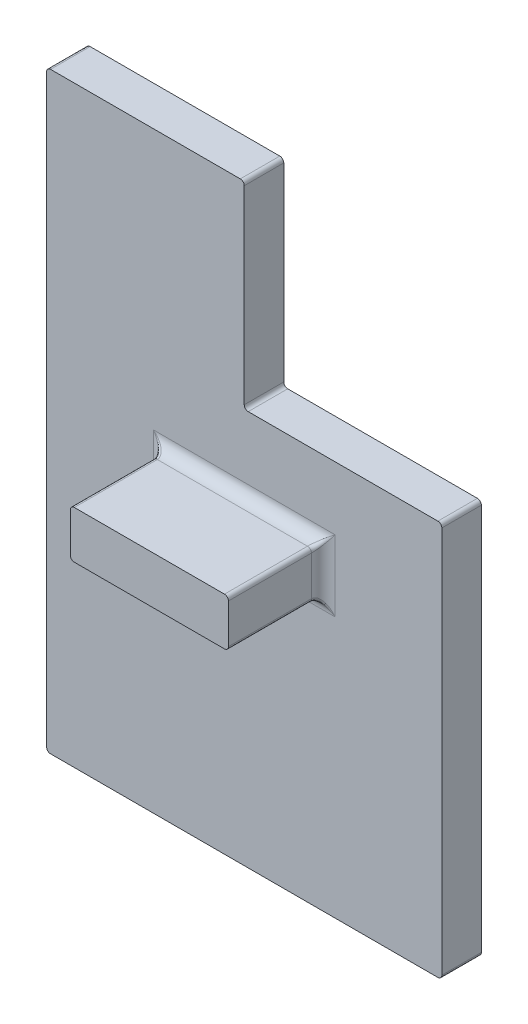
ISO-10303-21;
HEADER;
FILE_DESCRIPTION(('STEP AP214'),'2;1');
FILE_NAME('part.step','',(''),(''),'','','');
FILE_SCHEMA(('AUTOMOTIVE_DESIGN { 1 0 10303 214 1 1 1 1 }'));
ENDSEC;
DATA;
#1=APPLICATION_CONTEXT('core data for automotive mechanical design processes');
#2=APPLICATION_PROTOCOL_DEFINITION('international standard','automotive_design',2000,#1);
#3=PRODUCT_CONTEXT('',#1,'mechanical');
#4=PRODUCT('Part','Part','',(#3));
#5=PRODUCT_RELATED_PRODUCT_CATEGORY('part','',(#4));
#6=PRODUCT_DEFINITION_FORMATION('','',#4);
#7=PRODUCT_DEFINITION_CONTEXT('part definition',#1,'design');
#8=PRODUCT_DEFINITION('design','',#6,#7);
#9=PRODUCT_DEFINITION_SHAPE('','',#8);
#10=(LENGTH_UNIT() NAMED_UNIT(*) SI_UNIT(.MILLI.,.METRE.));
#11=(NAMED_UNIT(*) PLANE_ANGLE_UNIT() SI_UNIT($,.RADIAN.));
#12=(NAMED_UNIT(*) SI_UNIT($,.STERADIAN.) SOLID_ANGLE_UNIT());
#13=UNCERTAINTY_MEASURE_WITH_UNIT(LENGTH_MEASURE(1.E-05),#10,'distance_accuracy_value','');
#14=(GEOMETRIC_REPRESENTATION_CONTEXT(3) GLOBAL_UNCERTAINTY_ASSIGNED_CONTEXT((#13)) GLOBAL_UNIT_ASSIGNED_CONTEXT((#10,
#11,#12)) REPRESENTATION_CONTEXT('',''));
#15=CARTESIAN_POINT('',(0.,0.,0.));
#16=DIRECTION('',(0.,0.,1.));
#17=DIRECTION('',(1.,0.,0.));
#18=AXIS2_PLACEMENT_3D('',#15,#16,#17);
#19=CARTESIAN_POINT('',(0.,0.,5.));
#20=DIRECTION('',(0.,0.,-1.));
#21=DIRECTION('',(-1.,0.,0.));
#22=AXIS2_PLACEMENT_3D('',#19,#20,#21);
#23=PLANE('',#22);
#24=DIRECTION('',(0.,-1.,0.));
#25=VECTOR('',#24,1.);
#26=CARTESIAN_POINT('',(13.5,40.5,5.));
#27=LINE('',#26,#25);
#28=CARTESIAN_POINT('',(13.5,33.,5.));
#29=VERTEX_POINT('',#28);
#30=CARTESIAN_POINT('',(13.5,42.,5.));
#31=VERTEX_POINT('',#30);
#32=EDGE_CURVE('E316',#29,#31,#27,.F.);
#33=ORIENTED_EDGE('',*,*,#32,.T.);
#34=DIRECTION('',(-1.,0.,0.));
#35=VECTOR('',#34,1.);
#36=CARTESIAN_POINT('',(35.,42.,5.));
#37=LINE('',#36,#35);
#38=CARTESIAN_POINT('',(36.5,42.,5.));
#39=VERTEX_POINT('',#38);
#40=EDGE_CURVE('E324',#31,#39,#37,.F.);
#41=ORIENTED_EDGE('',*,*,#40,.T.);
#42=DIRECTION('',(0.,1.,0.));
#43=VECTOR('',#42,1.);
#44=CARTESIAN_POINT('',(36.5,34.5,5.));
#45=LINE('',#44,#43);
#46=CARTESIAN_POINT('',(36.5,33.,5.));
#47=VERTEX_POINT('',#46);
#48=EDGE_CURVE('E320',#39,#47,#45,.F.);
#49=ORIENTED_EDGE('',*,*,#48,.T.);
#50=DIRECTION('',(1.,0.,0.));
#51=VECTOR('',#50,1.);
#52=CARTESIAN_POINT('',(15.,33.,5.));
#53=LINE('',#52,#51);
#54=EDGE_CURVE('E312',#47,#29,#53,.F.);
#55=ORIENTED_EDGE('',*,*,#54,.T.);
#56=EDGE_LOOP('',(#33,#41,#49,#55));
#57=FACE_BOUND('',#56,.T.);
#58=DIRECTION('',(-1.,0.,0.));
#59=VECTOR('',#58,1.);
#60=CARTESIAN_POINT('',(0.,75.,5.));
#61=LINE('',#60,#59);
#62=CARTESIAN_POINT('',(24.5,75.,5.));
#63=VERTEX_POINT('',#62);
#64=CARTESIAN_POINT('',(0.5,75.,5.));
#65=VERTEX_POINT('',#64);
#66=EDGE_CURVE('E544',#63,#65,#61,.T.);
#67=ORIENTED_EDGE('',*,*,#66,.T.);
#68=CARTESIAN_POINT('',(0.5,74.5,5.));
#69=DIRECTION('',(0.,0.,-1.));
#70=DIRECTION('',(-1.,0.,0.));
#71=AXIS2_PLACEMENT_3D('',#68,#69,#70);
#72=CIRCLE('',#71,0.5);
#73=CARTESIAN_POINT('',(0.,74.5,5.));
#74=VERTEX_POINT('',#73);
#75=EDGE_CURVE('E272',#65,#74,#72,.F.);
#76=ORIENTED_EDGE('',*,*,#75,.T.);
#77=DIRECTION('',(0.,-1.,0.));
#78=VECTOR('',#77,1.);
#79=CARTESIAN_POINT('',(0.,0.,5.));
#80=LINE('',#79,#78);
#81=CARTESIAN_POINT('',(0.,0.5,5.));
#82=VERTEX_POINT('',#81);
#83=EDGE_CURVE('E223',#74,#82,#80,.T.);
#84=ORIENTED_EDGE('',*,*,#83,.T.);
#85=CARTESIAN_POINT('',(0.5,0.5,5.));
#86=DIRECTION('',(0.,0.,-1.));
#87=DIRECTION('',(-1.,0.,0.));
#88=AXIS2_PLACEMENT_3D('',#85,#86,#87);
#89=CIRCLE('',#88,0.5);
#90=CARTESIAN_POINT('',(0.5,0.,5.));
#91=VERTEX_POINT('',#90);
#92=EDGE_CURVE('E263',#82,#91,#89,.F.);
#93=ORIENTED_EDGE('',*,*,#92,.T.);
#94=DIRECTION('',(1.,0.,0.));
#95=VECTOR('',#94,1.);
#96=CARTESIAN_POINT('',(50.,0.,5.));
#97=LINE('',#96,#95);
#98=CARTESIAN_POINT('',(49.5,0.,5.));
#99=VERTEX_POINT('',#98);
#100=EDGE_CURVE('E232',#91,#99,#97,.T.);
#101=ORIENTED_EDGE('',*,*,#100,.T.);
#102=CARTESIAN_POINT('',(49.5,0.5,5.));
#103=DIRECTION('',(0.,0.,-1.));
#104=DIRECTION('',(-1.,0.,0.));
#105=AXIS2_PLACEMENT_3D('',#102,#103,#104);
#106=CIRCLE('',#105,0.5);
#107=CARTESIAN_POINT('',(50.,0.500000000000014,5.));
#108=VERTEX_POINT('',#107);
#109=EDGE_CURVE('E260',#99,#108,#106,.F.);
#110=ORIENTED_EDGE('',*,*,#109,.T.);
#111=DIRECTION('',(0.,1.,0.));
#112=VECTOR('',#111,1.);
#113=CARTESIAN_POINT('',(50.,50.,5.));
#114=LINE('',#113,#112);
#115=CARTESIAN_POINT('',(50.,49.5,5.));
#116=VERTEX_POINT('',#115);
#117=EDGE_CURVE('E238',#108,#116,#114,.T.);
#118=ORIENTED_EDGE('',*,*,#117,.T.);
#119=CARTESIAN_POINT('',(49.5,49.5,5.));
#120=DIRECTION('',(0.,0.,-1.));
#121=DIRECTION('',(-1.,0.,0.));
#122=AXIS2_PLACEMENT_3D('',#119,#120,#121);
#123=CIRCLE('',#122,0.5);
#124=CARTESIAN_POINT('',(49.5,50.,5.));
#125=VERTEX_POINT('',#124);
#126=EDGE_CURVE('E266',#116,#125,#123,.F.);
#127=ORIENTED_EDGE('',*,*,#126,.T.);
#128=DIRECTION('',(-1.,0.,0.));
#129=VECTOR('',#128,1.);
#130=CARTESIAN_POINT('',(25.,50.,5.));
#131=LINE('',#130,#129);
#132=CARTESIAN_POINT('',(25.5,50.,5.));
#133=VERTEX_POINT('',#132);
#134=EDGE_CURVE('E536',#125,#133,#131,.T.);
#135=ORIENTED_EDGE('',*,*,#134,.T.);
#136=CARTESIAN_POINT('',(25.5,50.5,5.));
#137=DIRECTION('',(0.,0.,-1.));
#138=DIRECTION('',(-1.,0.,0.));
#139=AXIS2_PLACEMENT_3D('',#136,#137,#138);
#140=CIRCLE('',#139,0.5);
#141=CARTESIAN_POINT('',(25.,50.5,5.));
#142=VERTEX_POINT('',#141);
#143=EDGE_CURVE('E306',#133,#142,#140,.T.);
#144=ORIENTED_EDGE('',*,*,#143,.T.);
#145=DIRECTION('',(0.,1.,0.));
#146=VECTOR('',#145,1.);
#147=CARTESIAN_POINT('',(25.,75.,5.));
#148=LINE('',#147,#146);
#149=CARTESIAN_POINT('',(25.,74.5,5.));
#150=VERTEX_POINT('',#149);
#151=EDGE_CURVE('E540',#142,#150,#148,.T.);
#152=ORIENTED_EDGE('',*,*,#151,.T.);
#153=CARTESIAN_POINT('',(24.5,74.5,5.));
#154=DIRECTION('',(0.,0.,-1.));
#155=DIRECTION('',(-1.,0.,0.));
#156=AXIS2_PLACEMENT_3D('',#153,#154,#155);
#157=CIRCLE('',#156,0.5);
#158=EDGE_CURVE('E269',#150,#63,#157,.F.);
#159=ORIENTED_EDGE('',*,*,#158,.T.);
#160=EDGE_LOOP('',(#67,#76,#84,#93,#101,#110,#118,#127,#135,#144,#152,#159));
#161=FACE_BOUND('',#160,.T.);
#162=ADVANCED_FACE('F50',(#57,#161),#23,.F.);
#163=CARTESIAN_POINT('',(50.,0.,5.));
#164=DIRECTION('',(0.,1.,0.));
#165=DIRECTION('',(-1.,0.,0.));
#166=AXIS2_PLACEMENT_3D('',#163,#164,#165);
#167=PLANE('',#166);
#168=ORIENTED_EDGE('',*,*,#100,.F.);
#169=DIRECTION('',(0.,0.,-1.));
#170=VECTOR('',#169,1.);
#171=CARTESIAN_POINT('',(0.5,0.,5.));
#172=LINE('',#171,#170);
#173=CARTESIAN_POINT('',(0.5,0.,0.));
#174=VERTEX_POINT('',#173);
#175=EDGE_CURVE('E299',#91,#174,#172,.T.);
#176=ORIENTED_EDGE('',*,*,#175,.T.);
#177=DIRECTION('',(1.,0.,0.));
#178=VECTOR('',#177,1.);
#179=CARTESIAN_POINT('',(50.,0.,0.));
#180=LINE('',#179,#178);
#181=CARTESIAN_POINT('',(49.5,0.,0.));
#182=VERTEX_POINT('',#181);
#183=EDGE_CURVE('E529',#174,#182,#180,.T.);
#184=ORIENTED_EDGE('',*,*,#183,.T.);
#185=DIRECTION('',(0.,0.,-1.));
#186=VECTOR('',#185,1.);
#187=CARTESIAN_POINT('',(49.5,0.,5.));
#188=LINE('',#187,#186);
#189=EDGE_CURVE('E296',#182,#99,#188,.F.);
#190=ORIENTED_EDGE('',*,*,#189,.T.);
#191=EDGE_LOOP('',(#168,#176,#184,#190));
#192=FACE_BOUND('',#191,.T.);
#193=ADVANCED_FACE('F585',(#192),#167,.F.);
#194=CARTESIAN_POINT('',(50.,50.,5.));
#195=DIRECTION('',(-1.,0.,0.));
#196=DIRECTION('',(0.,-1.,0.));
#197=AXIS2_PLACEMENT_3D('',#194,#195,#196);
#198=PLANE('',#197);
#199=DIRECTION('',(0.,1.,0.));
#200=VECTOR('',#199,1.);
#201=CARTESIAN_POINT('',(50.,50.,0.));
#202=LINE('',#201,#200);
#203=CARTESIAN_POINT('',(50.,0.500000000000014,0.));
#204=VERTEX_POINT('',#203);
#205=CARTESIAN_POINT('',(50.,49.5,0.));
#206=VERTEX_POINT('',#205);
#207=EDGE_CURVE('E553',#204,#206,#202,.T.);
#208=ORIENTED_EDGE('',*,*,#207,.T.);
#209=DIRECTION('',(0.,0.,-1.));
#210=VECTOR('',#209,1.);
#211=CARTESIAN_POINT('',(50.,49.5,5.));
#212=LINE('',#211,#210);
#213=EDGE_CURVE('E293',#206,#116,#212,.F.);
#214=ORIENTED_EDGE('',*,*,#213,.T.);
#215=ORIENTED_EDGE('',*,*,#117,.F.);
#216=DIRECTION('',(0.,0.,-1.));
#217=VECTOR('',#216,1.);
#218=CARTESIAN_POINT('',(50.,0.5,5.));
#219=LINE('',#218,#217);
#220=EDGE_CURVE('E289',#108,#204,#219,.T.);
#221=ORIENTED_EDGE('',*,*,#220,.T.);
#222=EDGE_LOOP('',(#208,#214,#215,#221));
#223=FACE_BOUND('',#222,.T.);
#224=ADVANCED_FACE('F592',(#223),#198,.F.);
#225=CARTESIAN_POINT('',(25.,50.,5.));
#226=DIRECTION('',(0.,-1.,0.));
#227=DIRECTION('',(0.,0.,-1.));
#228=AXIS2_PLACEMENT_3D('',#225,#226,#227);
#229=PLANE('',#228);
#230=DIRECTION('',(-1.,0.,0.));
#231=VECTOR('',#230,1.);
#232=CARTESIAN_POINT('',(25.,50.,0.));
#233=LINE('',#232,#231);
#234=CARTESIAN_POINT('',(49.5,50.,0.));
#235=VERTEX_POINT('',#234);
#236=CARTESIAN_POINT('',(25.5,50.,0.));
#237=VERTEX_POINT('',#236);
#238=EDGE_CURVE('E557',#235,#237,#233,.T.);
#239=ORIENTED_EDGE('',*,*,#238,.T.);
#240=DIRECTION('',(0.,0.,-1.));
#241=VECTOR('',#240,1.);
#242=CARTESIAN_POINT('',(25.5,50.,5.));
#243=LINE('',#242,#241);
#244=EDGE_CURVE('E286',#237,#133,#243,.F.);
#245=ORIENTED_EDGE('',*,*,#244,.T.);
#246=ORIENTED_EDGE('',*,*,#134,.F.);
#247=DIRECTION('',(0.,0.,-1.));
#248=VECTOR('',#247,1.);
#249=CARTESIAN_POINT('',(49.5,50.,5.));
#250=LINE('',#249,#248);
#251=EDGE_CURVE('E282',#125,#235,#250,.T.);
#252=ORIENTED_EDGE('',*,*,#251,.T.);
#253=EDGE_LOOP('',(#239,#245,#246,#252));
#254=FACE_BOUND('',#253,.T.);
#255=ADVANCED_FACE('F582',(#254),#229,.F.);
#256=CARTESIAN_POINT('',(25.,75.,5.));
#257=DIRECTION('',(-1.,0.,0.));
#258=DIRECTION('',(0.,0.,1.));
#259=AXIS2_PLACEMENT_3D('',#256,#257,#258);
#260=PLANE('',#259);
#261=ORIENTED_EDGE('',*,*,#151,.F.);
#262=DIRECTION('',(0.,0.,-1.));
#263=VECTOR('',#262,1.);
#264=CARTESIAN_POINT('',(25.,50.5,0.));
#265=LINE('',#264,#263);
#266=CARTESIAN_POINT('',(25.,50.5,0.));
#267=VERTEX_POINT('',#266);
#268=EDGE_CURVE('E278',#142,#267,#265,.T.);
#269=ORIENTED_EDGE('',*,*,#268,.T.);
#270=DIRECTION('',(0.,1.,0.));
#271=VECTOR('',#270,1.);
#272=CARTESIAN_POINT('',(25.,75.,0.));
#273=LINE('',#272,#271);
#274=CARTESIAN_POINT('',(25.,74.5,0.));
#275=VERTEX_POINT('',#274);
#276=EDGE_CURVE('E240',#267,#275,#273,.T.);
#277=ORIENTED_EDGE('',*,*,#276,.T.);
#278=DIRECTION('',(0.,0.,-1.));
#279=VECTOR('',#278,1.);
#280=CARTESIAN_POINT('',(25.,74.5,5.));
#281=LINE('',#280,#279);
#282=EDGE_CURVE('E275',#275,#150,#281,.F.);
#283=ORIENTED_EDGE('',*,*,#282,.T.);
#284=EDGE_LOOP('',(#261,#269,#277,#283));
#285=FACE_BOUND('',#284,.T.);
#286=ADVANCED_FACE('F566',(#285),#260,.F.);
#287=CARTESIAN_POINT('',(0.,75.,5.));
#288=DIRECTION('',(0.,-1.,0.));
#289=DIRECTION('',(0.,0.,-1.));
#290=AXIS2_PLACEMENT_3D('',#287,#288,#289);
#291=PLANE('',#290);
#292=DIRECTION('',(-1.,0.,0.));
#293=VECTOR('',#292,1.);
#294=CARTESIAN_POINT('',(0.,75.,0.));
#295=LINE('',#294,#293);
#296=CARTESIAN_POINT('',(24.5,75.,0.));
#297=VERTEX_POINT('',#296);
#298=CARTESIAN_POINT('',(0.5,75.,0.));
#299=VERTEX_POINT('',#298);
#300=EDGE_CURVE('E233',#297,#299,#295,.T.);
#301=ORIENTED_EDGE('',*,*,#300,.T.);
#302=DIRECTION('',(0.,0.,-1.));
#303=VECTOR('',#302,1.);
#304=CARTESIAN_POINT('',(0.5,75.,5.));
#305=LINE('',#304,#303);
#306=EDGE_CURVE('E207',#299,#65,#305,.F.);
#307=ORIENTED_EDGE('',*,*,#306,.T.);
#308=ORIENTED_EDGE('',*,*,#66,.F.);
#309=DIRECTION('',(0.,0.,-1.));
#310=VECTOR('',#309,1.);
#311=CARTESIAN_POINT('',(24.5,75.,5.));
#312=LINE('',#311,#310);
#313=EDGE_CURVE('E213',#63,#297,#312,.T.);
#314=ORIENTED_EDGE('',*,*,#313,.T.);
#315=EDGE_LOOP('',(#301,#307,#308,#314));
#316=FACE_BOUND('',#315,.T.);
#317=ADVANCED_FACE('F574',(#316),#291,.F.);
#318=CARTESIAN_POINT('',(0.,0.,5.));
#319=DIRECTION('',(1.,0.,0.));
#320=DIRECTION('',(0.,0.,-1.));
#321=AXIS2_PLACEMENT_3D('',#318,#319,#320);
#322=PLANE('',#321);
#323=ORIENTED_EDGE('',*,*,#83,.F.);
#324=DIRECTION('',(0.,0.,-1.));
#325=VECTOR('',#324,1.);
#326=CARTESIAN_POINT('',(0.,74.5,5.));
#327=LINE('',#326,#325);
#328=CARTESIAN_POINT('',(0.,74.5,0.));
#329=VERTEX_POINT('',#328);
#330=EDGE_CURVE('E206',#74,#329,#327,.T.);
#331=ORIENTED_EDGE('',*,*,#330,.T.);
#332=DIRECTION('',(0.,-1.,0.));
#333=VECTOR('',#332,1.);
#334=CARTESIAN_POINT('',(0.,0.,0.));
#335=LINE('',#334,#333);
#336=CARTESIAN_POINT('',(0.,0.5,0.));
#337=VERTEX_POINT('',#336);
#338=EDGE_CURVE('E220',#329,#337,#335,.T.);
#339=ORIENTED_EDGE('',*,*,#338,.T.);
#340=DIRECTION('',(0.,0.,-1.));
#341=VECTOR('',#340,1.);
#342=CARTESIAN_POINT('',(0.,0.5,5.));
#343=LINE('',#342,#341);
#344=EDGE_CURVE('E226',#337,#82,#343,.F.);
#345=ORIENTED_EDGE('',*,*,#344,.T.);
#346=EDGE_LOOP('',(#323,#331,#339,#345));
#347=FACE_BOUND('',#346,.T.);
#348=ADVANCED_FACE('F219',(#347),#322,.F.);
#349=CARTESIAN_POINT('',(0.,0.,0.));
#350=DIRECTION('',(0.,0.,-1.));
#351=DIRECTION('',(-1.,0.,0.));
#352=AXIS2_PLACEMENT_3D('',#349,#350,#351);
#353=PLANE('',#352);
#354=ORIENTED_EDGE('',*,*,#338,.F.);
#355=CARTESIAN_POINT('',(0.5,74.5,0.));
#356=DIRECTION('',(0.,0.,-1.));
#357=DIRECTION('',(-1.,0.,0.));
#358=AXIS2_PLACEMENT_3D('',#355,#356,#357);
#359=CIRCLE('',#358,0.5);
#360=EDGE_CURVE('E202',#329,#299,#359,.T.);
#361=ORIENTED_EDGE('',*,*,#360,.T.);
#362=ORIENTED_EDGE('',*,*,#300,.F.);
#363=CARTESIAN_POINT('',(24.5,74.5,0.));
#364=DIRECTION('',(0.,0.,-1.));
#365=DIRECTION('',(-1.,0.,0.));
#366=AXIS2_PLACEMENT_3D('',#363,#364,#365);
#367=CIRCLE('',#366,0.5);
#368=EDGE_CURVE('E214',#297,#275,#367,.T.);
#369=ORIENTED_EDGE('',*,*,#368,.T.);
#370=ORIENTED_EDGE('',*,*,#276,.F.);
#371=CARTESIAN_POINT('',(25.5,50.5,0.));
#372=DIRECTION('',(0.,0.,-1.));
#373=DIRECTION('',(-1.,0.,0.));
#374=AXIS2_PLACEMENT_3D('',#371,#372,#373);
#375=CIRCLE('',#374,0.5);
#376=EDGE_CURVE('E303',#267,#237,#375,.F.);
#377=ORIENTED_EDGE('',*,*,#376,.T.);
#378=ORIENTED_EDGE('',*,*,#238,.F.);
#379=CARTESIAN_POINT('',(49.5,49.5,0.));
#380=DIRECTION('',(0.,0.,-1.));
#381=DIRECTION('',(-1.,0.,0.));
#382=AXIS2_PLACEMENT_3D('',#379,#380,#381);
#383=CIRCLE('',#382,0.5);
#384=EDGE_CURVE('E250',#235,#206,#383,.T.);
#385=ORIENTED_EDGE('',*,*,#384,.T.);
#386=ORIENTED_EDGE('',*,*,#207,.F.);
#387=CARTESIAN_POINT('',(49.5,0.5,0.));
#388=DIRECTION('',(0.,0.,-1.));
#389=DIRECTION('',(-1.,0.,0.));
#390=AXIS2_PLACEMENT_3D('',#387,#388,#389);
#391=CIRCLE('',#390,0.5);
#392=EDGE_CURVE('E225',#204,#182,#391,.T.);
#393=ORIENTED_EDGE('',*,*,#392,.T.);
#394=ORIENTED_EDGE('',*,*,#183,.F.);
#395=CARTESIAN_POINT('',(0.5,0.5,0.));
#396=DIRECTION('',(0.,0.,-1.));
#397=DIRECTION('',(-1.,0.,0.));
#398=AXIS2_PLACEMENT_3D('',#395,#396,#397);
#399=CIRCLE('',#398,0.5);
#400=EDGE_CURVE('E230',#174,#337,#399,.T.);
#401=ORIENTED_EDGE('',*,*,#400,.T.);
#402=EDGE_LOOP('',(#354,#361,#362,#369,#370,#377,#378,#385,#386,#393,#394,#401));
#403=FACE_BOUND('',#402,.T.);
#404=ADVANCED_FACE('F228',(#403),#353,.T.);
#405=CARTESIAN_POINT('',(0.5,74.5,5.));
#406=DIRECTION('',(0.,0.,-1.));
#407=DIRECTION('',(-1.,0.,0.));
#408=AXIS2_PLACEMENT_3D('',#405,#406,#407);
#409=CYLINDRICAL_SURFACE('',#408,0.5);
#410=ORIENTED_EDGE('',*,*,#75,.F.);
#411=ORIENTED_EDGE('',*,*,#306,.F.);
#412=ORIENTED_EDGE('',*,*,#360,.F.);
#413=ORIENTED_EDGE('',*,*,#330,.F.);
#414=EDGE_LOOP('',(#410,#411,#412,#413));
#415=FACE_BOUND('',#414,.T.);
#416=ADVANCED_FACE('F205',(#415),#409,.T.);
#417=CARTESIAN_POINT('',(25.5,50.5,5.));
#418=DIRECTION('',(0.,0.,1.));
#419=DIRECTION('',(1.,0.,0.));
#420=AXIS2_PLACEMENT_3D('',#417,#418,#419);
#421=CYLINDRICAL_SURFACE('',#420,0.5);
#422=ORIENTED_EDGE('',*,*,#143,.F.);
#423=ORIENTED_EDGE('',*,*,#244,.F.);
#424=ORIENTED_EDGE('',*,*,#376,.F.);
#425=ORIENTED_EDGE('',*,*,#268,.F.);
#426=EDGE_LOOP('',(#422,#423,#424,#425));
#427=FACE_BOUND('',#426,.T.);
#428=ADVANCED_FACE('F603',(#427),#421,.F.);
#429=CARTESIAN_POINT('',(24.5,74.5,5.));
#430=DIRECTION('',(0.,0.,-1.));
#431=DIRECTION('',(-1.,0.,0.));
#432=AXIS2_PLACEMENT_3D('',#429,#430,#431);
#433=CYLINDRICAL_SURFACE('',#432,0.5);
#434=ORIENTED_EDGE('',*,*,#158,.F.);
#435=ORIENTED_EDGE('',*,*,#282,.F.);
#436=ORIENTED_EDGE('',*,*,#368,.F.);
#437=ORIENTED_EDGE('',*,*,#313,.F.);
#438=EDGE_LOOP('',(#434,#435,#436,#437));
#439=FACE_BOUND('',#438,.T.);
#440=ADVANCED_FACE('F570',(#439),#433,.T.);
#441=CARTESIAN_POINT('',(49.5,49.5,5.));
#442=DIRECTION('',(0.,0.,-1.));
#443=DIRECTION('',(-1.,0.,0.));
#444=AXIS2_PLACEMENT_3D('',#441,#442,#443);
#445=CYLINDRICAL_SURFACE('',#444,0.5);
#446=ORIENTED_EDGE('',*,*,#126,.F.);
#447=ORIENTED_EDGE('',*,*,#213,.F.);
#448=ORIENTED_EDGE('',*,*,#384,.F.);
#449=ORIENTED_EDGE('',*,*,#251,.F.);
#450=EDGE_LOOP('',(#446,#447,#448,#449));
#451=FACE_BOUND('',#450,.T.);
#452=ADVANCED_FACE('F614',(#451),#445,.T.);
#453=CARTESIAN_POINT('',(0.5,0.5,5.));
#454=DIRECTION('',(0.,0.,-1.));
#455=DIRECTION('',(-1.,0.,0.));
#456=AXIS2_PLACEMENT_3D('',#453,#454,#455);
#457=CYLINDRICAL_SURFACE('',#456,0.5);
#458=ORIENTED_EDGE('',*,*,#92,.F.);
#459=ORIENTED_EDGE('',*,*,#344,.F.);
#460=ORIENTED_EDGE('',*,*,#400,.F.);
#461=ORIENTED_EDGE('',*,*,#175,.F.);
#462=EDGE_LOOP('',(#458,#459,#460,#461));
#463=FACE_BOUND('',#462,.T.);
#464=ADVANCED_FACE('F616',(#463),#457,.T.);
#465=CARTESIAN_POINT('',(49.5,0.5,5.));
#466=DIRECTION('',(0.,0.,-1.));
#467=DIRECTION('',(-1.,0.,0.));
#468=AXIS2_PLACEMENT_3D('',#465,#466,#467);
#469=CYLINDRICAL_SURFACE('',#468,0.5);
#470=ORIENTED_EDGE('',*,*,#109,.F.);
#471=ORIENTED_EDGE('',*,*,#189,.F.);
#472=ORIENTED_EDGE('',*,*,#392,.F.);
#473=ORIENTED_EDGE('',*,*,#220,.F.);
#474=EDGE_LOOP('',(#470,#471,#472,#473));
#475=FACE_BOUND('',#474,.T.);
#476=ADVANCED_FACE('F444',(#475),#469,.T.);
#477=CARTESIAN_POINT('',(15.,40.5,17.));
#478=DIRECTION('',(1.,0.,0.));
#479=DIRECTION('',(0.,1.,0.));
#480=AXIS2_PLACEMENT_3D('',#477,#478,#479);
#481=PLANE('',#480);
#482=DIRECTION('',(0.,-1.,0.));
#483=VECTOR('',#482,1.);
#484=CARTESIAN_POINT('',(15.,34.5,6.5));
#485=LINE('',#484,#483);
#486=CARTESIAN_POINT('',(15.,40.,6.5));
#487=VERTEX_POINT('',#486);
#488=CARTESIAN_POINT('',(15.,35.,6.5));
#489=VERTEX_POINT('',#488);
#490=EDGE_CURVE('E332',#487,#489,#485,.T.);
#491=ORIENTED_EDGE('',*,*,#490,.T.);
#492=DIRECTION('',(0.,0.,-1.));
#493=VECTOR('',#492,1.);
#494=CARTESIAN_POINT('',(15.,35.,17.));
#495=LINE('',#494,#493);
#496=CARTESIAN_POINT('',(15.,35.,17.));
#497=VERTEX_POINT('',#496);
#498=EDGE_CURVE('E394',#489,#497,#495,.F.);
#499=ORIENTED_EDGE('',*,*,#498,.T.);
#500=DIRECTION('',(0.,-1.,0.));
#501=VECTOR('',#500,1.);
#502=CARTESIAN_POINT('',(15.,40.5,17.));
#503=LINE('',#502,#501);
#504=CARTESIAN_POINT('',(15.,40.,17.));
#505=VERTEX_POINT('',#504);
#506=EDGE_CURVE('E403',#505,#497,#503,.T.);
#507=ORIENTED_EDGE('',*,*,#506,.F.);
#508=DIRECTION('',(0.,0.,-1.));
#509=VECTOR('',#508,1.);
#510=CARTESIAN_POINT('',(15.,40.,17.));
#511=LINE('',#510,#509);
#512=EDGE_CURVE('E391',#505,#487,#511,.T.);
#513=ORIENTED_EDGE('',*,*,#512,.T.);
#514=EDGE_LOOP('',(#491,#499,#507,#513));
#515=FACE_BOUND('',#514,.T.);
#516=ADVANCED_FACE('F482',(#515),#481,.F.);
#517=CARTESIAN_POINT('',(15.,34.5,17.));
#518=DIRECTION('',(0.,1.,0.));
#519=DIRECTION('',(0.,0.,1.));
#520=AXIS2_PLACEMENT_3D('',#517,#518,#519);
#521=PLANE('',#520);
#522=DIRECTION('',(1.,0.,0.));
#523=VECTOR('',#522,1.);
#524=CARTESIAN_POINT('',(35.,34.5,6.5));
#525=LINE('',#524,#523);
#526=CARTESIAN_POINT('',(15.5,34.5,6.5));
#527=VERTEX_POINT('',#526);
#528=CARTESIAN_POINT('',(34.5,34.5,6.5));
#529=VERTEX_POINT('',#528);
#530=EDGE_CURVE('E336',#527,#529,#525,.T.);
#531=ORIENTED_EDGE('',*,*,#530,.T.);
#532=DIRECTION('',(0.,0.,-1.));
#533=VECTOR('',#532,1.);
#534=CARTESIAN_POINT('',(34.5,34.5,17.));
#535=LINE('',#534,#533);
#536=CARTESIAN_POINT('',(34.5,34.5,17.));
#537=VERTEX_POINT('',#536);
#538=EDGE_CURVE('E377',#529,#537,#535,.F.);
#539=ORIENTED_EDGE('',*,*,#538,.T.);
#540=DIRECTION('',(1.,0.,0.));
#541=VECTOR('',#540,1.);
#542=CARTESIAN_POINT('',(15.,34.5,17.));
#543=LINE('',#542,#541);
#544=CARTESIAN_POINT('',(15.5,34.5,17.));
#545=VERTEX_POINT('',#544);
#546=EDGE_CURVE('E513',#545,#537,#543,.T.);
#547=ORIENTED_EDGE('',*,*,#546,.F.);
#548=DIRECTION('',(0.,0.,-1.));
#549=VECTOR('',#548,1.);
#550=CARTESIAN_POINT('',(15.5,34.5,17.));
#551=LINE('',#550,#549);
#552=EDGE_CURVE('E374',#545,#527,#551,.T.);
#553=ORIENTED_EDGE('',*,*,#552,.T.);
#554=EDGE_LOOP('',(#531,#539,#547,#553));
#555=FACE_BOUND('',#554,.T.);
#556=ADVANCED_FACE('F503',(#555),#521,.F.);
#557=CARTESIAN_POINT('',(35.,40.5,17.));
#558=DIRECTION('',(-1.,0.,0.));
#559=DIRECTION('',(0.,0.,1.));
#560=AXIS2_PLACEMENT_3D('',#557,#558,#559);
#561=PLANE('',#560);
#562=DIRECTION('',(0.,1.,0.));
#563=VECTOR('',#562,1.);
#564=CARTESIAN_POINT('',(35.,40.5,17.));
#565=LINE('',#564,#563);
#566=CARTESIAN_POINT('',(35.,35.,17.));
#567=VERTEX_POINT('',#566);
#568=CARTESIAN_POINT('',(35.,40.,17.));
#569=VERTEX_POINT('',#568);
#570=EDGE_CURVE('E512',#567,#569,#565,.T.);
#571=ORIENTED_EDGE('',*,*,#570,.F.);
#572=DIRECTION('',(0.,0.,-1.));
#573=VECTOR('',#572,1.);
#574=CARTESIAN_POINT('',(35.,35.,17.));
#575=LINE('',#574,#573);
#576=CARTESIAN_POINT('',(35.,35.,6.5));
#577=VERTEX_POINT('',#576);
#578=EDGE_CURVE('E371',#567,#577,#575,.T.);
#579=ORIENTED_EDGE('',*,*,#578,.T.);
#580=DIRECTION('',(0.,1.,0.));
#581=VECTOR('',#580,1.);
#582=CARTESIAN_POINT('',(35.,40.5,6.5));
#583=LINE('',#582,#581);
#584=CARTESIAN_POINT('',(35.,40.,6.5));
#585=VERTEX_POINT('',#584);
#586=EDGE_CURVE('E328',#577,#585,#583,.T.);
#587=ORIENTED_EDGE('',*,*,#586,.T.);
#588=DIRECTION('',(0.,0.,-1.));
#589=VECTOR('',#588,1.);
#590=CARTESIAN_POINT('',(35.,40.,17.));
#591=LINE('',#590,#589);
#592=EDGE_CURVE('E368',#585,#569,#591,.F.);
#593=ORIENTED_EDGE('',*,*,#592,.T.);
#594=EDGE_LOOP('',(#571,#579,#587,#593));
#595=FACE_BOUND('',#594,.T.);
#596=ADVANCED_FACE('F515',(#595),#561,.F.);
#597=CARTESIAN_POINT('',(15.,40.5,17.));
#598=DIRECTION('',(0.,-1.,0.));
#599=DIRECTION('',(0.,0.,-1.));
#600=AXIS2_PLACEMENT_3D('',#597,#598,#599);
#601=PLANE('',#600);
#602=DIRECTION('',(-1.,0.,0.));
#603=VECTOR('',#602,1.);
#604=CARTESIAN_POINT('',(15.,40.5,6.5));
#605=LINE('',#604,#603);
#606=CARTESIAN_POINT('',(34.5,40.5,6.5));
#607=VERTEX_POINT('',#606);
#608=CARTESIAN_POINT('',(15.5,40.5,6.5));
#609=VERTEX_POINT('',#608);
#610=EDGE_CURVE('E309',#607,#609,#605,.T.);
#611=ORIENTED_EDGE('',*,*,#610,.T.);
#612=DIRECTION('',(0.,0.,-1.));
#613=VECTOR('',#612,1.);
#614=CARTESIAN_POINT('',(15.5,40.5,17.));
#615=LINE('',#614,#613);
#616=CARTESIAN_POINT('',(15.5,40.5,17.));
#617=VERTEX_POINT('',#616);
#618=EDGE_CURVE('E11',#609,#617,#615,.F.);
#619=ORIENTED_EDGE('',*,*,#618,.T.);
#620=DIRECTION('',(-1.,0.,0.));
#621=VECTOR('',#620,1.);
#622=CARTESIAN_POINT('',(15.,40.5,17.));
#623=LINE('',#622,#621);
#624=CARTESIAN_POINT('',(34.5,40.5,17.));
#625=VERTEX_POINT('',#624);
#626=EDGE_CURVE('E490',#625,#617,#623,.T.);
#627=ORIENTED_EDGE('',*,*,#626,.F.);
#628=DIRECTION('',(0.,0.,-1.));
#629=VECTOR('',#628,1.);
#630=CARTESIAN_POINT('',(34.5,40.5,17.));
#631=LINE('',#630,#629);
#632=EDGE_CURVE('E60',#625,#607,#631,.T.);
#633=ORIENTED_EDGE('',*,*,#632,.T.);
#634=EDGE_LOOP('',(#611,#619,#627,#633));
#635=FACE_BOUND('',#634,.T.);
#636=ADVANCED_FACE('F488',(#635),#601,.F.);
#637=CARTESIAN_POINT('',(0.,0.,17.));
#638=DIRECTION('',(0.,0.,1.));
#639=DIRECTION('',(1.,0.,0.));
#640=AXIS2_PLACEMENT_3D('',#637,#638,#639);
#641=PLANE('',#640);
#642=ORIENTED_EDGE('',*,*,#546,.T.);
#643=CARTESIAN_POINT('',(34.5,35.,17.));
#644=DIRECTION('',(0.,0.,1.));
#645=DIRECTION('',(1.,0.,0.));
#646=AXIS2_PLACEMENT_3D('',#643,#644,#645);
#647=CIRCLE('',#646,0.5);
#648=EDGE_CURVE('E388',#537,#567,#647,.T.);
#649=ORIENTED_EDGE('',*,*,#648,.T.);
#650=ORIENTED_EDGE('',*,*,#570,.T.);
#651=CARTESIAN_POINT('',(34.5,40.,17.));
#652=DIRECTION('',(0.,0.,1.));
#653=DIRECTION('',(1.,0.,0.));
#654=AXIS2_PLACEMENT_3D('',#651,#652,#653);
#655=CIRCLE('',#654,0.5);
#656=EDGE_CURVE('E73',#569,#625,#655,.T.);
#657=ORIENTED_EDGE('',*,*,#656,.T.);
#658=ORIENTED_EDGE('',*,*,#626,.T.);
#659=CARTESIAN_POINT('',(15.5,40.,17.));
#660=DIRECTION('',(0.,0.,1.));
#661=DIRECTION('',(1.,0.,0.));
#662=AXIS2_PLACEMENT_3D('',#659,#660,#661);
#663=CIRCLE('',#662,0.5);
#664=EDGE_CURVE('E382',#617,#505,#663,.T.);
#665=ORIENTED_EDGE('',*,*,#664,.T.);
#666=ORIENTED_EDGE('',*,*,#506,.T.);
#667=CARTESIAN_POINT('',(15.5,35.,17.));
#668=DIRECTION('',(0.,0.,1.));
#669=DIRECTION('',(1.,0.,0.));
#670=AXIS2_PLACEMENT_3D('',#667,#668,#669);
#671=CIRCLE('',#670,0.5);
#672=EDGE_CURVE('E385',#497,#545,#671,.T.);
#673=ORIENTED_EDGE('',*,*,#672,.T.);
#674=EDGE_LOOP('',(#642,#649,#650,#657,#658,#665,#666,#673));
#675=FACE_BOUND('',#674,.T.);
#676=ADVANCED_FACE('F511',(#675),#641,.T.);
#677=CARTESIAN_POINT('',(15.,33.,6.5));
#678=DIRECTION('',(-1.,0.,0.));
#679=DIRECTION('',(0.,0.,1.));
#680=AXIS2_PLACEMENT_3D('',#677,#678,#679);
#681=CYLINDRICAL_SURFACE('',#680,1.5);
#682=ORIENTED_EDGE('',*,*,#54,.F.);
#683=CARTESIAN_POINT('',(36.5,33.,6.5));
#684=DIRECTION('',(0.6,0.8,0.));
#685=DIRECTION('',(0.8,-0.6,0.));
#686=AXIS2_PLACEMENT_3D('',#683,#684,#685);
#687=ELLIPSE('',#686,2.5,1.5);
#688=EDGE_CURVE('E350',#47,#529,#687,.T.);
#689=ORIENTED_EDGE('',*,*,#688,.T.);
#690=ORIENTED_EDGE('',*,*,#530,.F.);
#691=CARTESIAN_POINT('',(13.5,33.,6.5));
#692=DIRECTION('',(0.6,-0.8,0.));
#693=DIRECTION('',(0.8,0.6,0.));
#694=AXIS2_PLACEMENT_3D('',#691,#692,#693);
#695=ELLIPSE('',#694,2.5,1.5);
#696=EDGE_CURVE('E347',#527,#29,#695,.F.);
#697=ORIENTED_EDGE('',*,*,#696,.T.);
#698=EDGE_LOOP('',(#682,#689,#690,#697));
#699=FACE_BOUND('',#698,.T.);
#700=ADVANCED_FACE('F419',(#699),#681,.F.);
#701=CARTESIAN_POINT('',(36.5,40.5,6.5));
#702=DIRECTION('',(0.,-1.,0.));
#703=DIRECTION('',(0.,0.,-1.));
#704=AXIS2_PLACEMENT_3D('',#701,#702,#703);
#705=CYLINDRICAL_SURFACE('',#704,1.5);
#706=ORIENTED_EDGE('',*,*,#586,.F.);
#707=CARTESIAN_POINT('',(36.5,33.,6.5));
#708=DIRECTION('',(0.799999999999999,0.6,0.));
#709=DIRECTION('',(0.6,-0.8,0.));
#710=AXIS2_PLACEMENT_3D('',#707,#708,#709);
#711=ELLIPSE('',#710,2.5,1.5);
#712=EDGE_CURVE('E343',#577,#47,#711,.F.);
#713=ORIENTED_EDGE('',*,*,#712,.T.);
#714=ORIENTED_EDGE('',*,*,#48,.F.);
#715=CARTESIAN_POINT('',(36.5,42.,6.5));
#716=DIRECTION('',(-0.8,0.6,0.));
#717=DIRECTION('',(0.6,0.8,0.));
#718=AXIS2_PLACEMENT_3D('',#715,#716,#717);
#719=ELLIPSE('',#718,2.5,1.5);
#720=EDGE_CURVE('E340',#39,#585,#719,.T.);
#721=ORIENTED_EDGE('',*,*,#720,.T.);
#722=EDGE_LOOP('',(#706,#713,#714,#721));
#723=FACE_BOUND('',#722,.T.);
#724=ADVANCED_FACE('F422',(#723),#705,.F.);
#725=CARTESIAN_POINT('',(13.5,40.5,6.5));
#726=DIRECTION('',(0.,1.,0.));
#727=DIRECTION('',(-1.,0.,0.));
#728=AXIS2_PLACEMENT_3D('',#725,#726,#727);
#729=CYLINDRICAL_SURFACE('',#728,1.5);
#730=ORIENTED_EDGE('',*,*,#32,.F.);
#731=CARTESIAN_POINT('',(13.5,33.,6.5));
#732=DIRECTION('',(0.8,-0.599999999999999,0.));
#733=DIRECTION('',(0.599999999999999,0.8,0.));
#734=AXIS2_PLACEMENT_3D('',#731,#732,#733);
#735=ELLIPSE('',#734,2.5,1.5);
#736=EDGE_CURVE('E356',#29,#489,#735,.T.);
#737=ORIENTED_EDGE('',*,*,#736,.T.);
#738=ORIENTED_EDGE('',*,*,#490,.F.);
#739=CARTESIAN_POINT('',(13.5,42.,6.5));
#740=DIRECTION('',(-0.8,-0.6,0.));
#741=DIRECTION('',(0.6,-0.8,0.));
#742=AXIS2_PLACEMENT_3D('',#739,#740,#741);
#743=ELLIPSE('',#742,2.5,1.5);
#744=EDGE_CURVE('E353',#487,#31,#743,.F.);
#745=ORIENTED_EDGE('',*,*,#744,.T.);
#746=EDGE_LOOP('',(#730,#737,#738,#745));
#747=FACE_BOUND('',#746,.T.);
#748=ADVANCED_FACE('F426',(#747),#729,.F.);
#749=CARTESIAN_POINT('',(15.,42.,6.5));
#750=DIRECTION('',(1.,0.,0.));
#751=DIRECTION('',(0.,0.,-1.));
#752=AXIS2_PLACEMENT_3D('',#749,#750,#751);
#753=CYLINDRICAL_SURFACE('',#752,1.5);
#754=ORIENTED_EDGE('',*,*,#40,.F.);
#755=CARTESIAN_POINT('',(13.5,42.,6.5));
#756=DIRECTION('',(-0.6,-0.8,0.));
#757=DIRECTION('',(0.8,-0.6,0.));
#758=AXIS2_PLACEMENT_3D('',#755,#756,#757);
#759=ELLIPSE('',#758,2.5,1.5);
#760=EDGE_CURVE('E364',#31,#609,#759,.T.);
#761=ORIENTED_EDGE('',*,*,#760,.T.);
#762=ORIENTED_EDGE('',*,*,#610,.F.);
#763=CARTESIAN_POINT('',(36.5,42.,6.5));
#764=DIRECTION('',(-0.6,0.8,0.));
#765=DIRECTION('',(0.8,0.6,0.));
#766=AXIS2_PLACEMENT_3D('',#763,#764,#765);
#767=ELLIPSE('',#766,2.5,1.5);
#768=EDGE_CURVE('E360',#607,#39,#767,.F.);
#769=ORIENTED_EDGE('',*,*,#768,.T.);
#770=EDGE_LOOP('',(#754,#761,#762,#769));
#771=FACE_BOUND('',#770,.T.);
#772=ADVANCED_FACE('F439',(#771),#753,.F.);
#773=CARTESIAN_POINT('',(34.5,35.,17.));
#774=DIRECTION('',(0.,0.,-1.));
#775=DIRECTION('',(-1.,0.,0.));
#776=AXIS2_PLACEMENT_3D('',#773,#774,#775);
#777=CYLINDRICAL_SURFACE('',#776,0.5);
#778=ORIENTED_EDGE('',*,*,#648,.F.);
#779=ORIENTED_EDGE('',*,*,#538,.F.);
#780=CARTESIAN_POINT('',(34.5,35.,6.5));
#781=DIRECTION('',(0.,0.,-1.));
#782=DIRECTION('',(-1.,0.,0.));
#783=AXIS2_PLACEMENT_3D('',#780,#781,#782);
#784=CIRCLE('',#783,0.5);
#785=EDGE_CURVE('E399',#577,#529,#784,.T.);
#786=ORIENTED_EDGE('',*,*,#785,.F.);
#787=ORIENTED_EDGE('',*,*,#578,.F.);
#788=EDGE_LOOP('',(#778,#779,#786,#787));
#789=FACE_BOUND('',#788,.T.);
#790=ADVANCED_FACE('F417',(#789),#777,.T.);
#791=CARTESIAN_POINT('',(36.5,33.,8.));
#792=CARTESIAN_POINT('',(36.5,33.,8.));
#793=CARTESIAN_POINT('',(36.5,33.,8.));
#794=CARTESIAN_POINT('',(36.4128705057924,33.0653471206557,7.99997370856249));
#795=CARTESIAN_POINT('',(36.4237465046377,33.0762534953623,8.00009886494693));
#796=CARTESIAN_POINT('',(36.4346528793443,33.0871294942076,7.99997370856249));
#797=CARTESIAN_POINT('',(36.3257187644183,33.1307109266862,7.99572763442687));
#798=CARTESIAN_POINT('',(36.3472831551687,33.1527168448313,7.99430068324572));
#799=CARTESIAN_POINT('',(36.3692890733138,33.1742812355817,7.99572763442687));
#800=CARTESIAN_POINT('',(36.1529140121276,33.2603144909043,7.97867971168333));
#801=CARTESIAN_POINT('',(36.1966502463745,33.3033497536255,7.97154804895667));
#802=CARTESIAN_POINT('',(36.2396855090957,33.3470859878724,7.97867971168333));
#803=CARTESIAN_POINT('',(36.0672545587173,33.3245590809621,7.96595089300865));
#804=CARTESIAN_POINT('',(36.12204814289,33.37795185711,7.95456095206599));
#805=CARTESIAN_POINT('',(36.175440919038,33.4327454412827,7.96595089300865));
#806=CARTESIAN_POINT('',(35.8988931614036,33.4508301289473,7.93211276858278));
#807=CARTESIAN_POINT('',(35.9769792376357,33.5230207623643,7.90986913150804));
#808=CARTESIAN_POINT('',(36.0491698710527,33.6011068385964,7.93211276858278));
#809=CARTESIAN_POINT('',(35.8161657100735,33.5128757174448,7.91114760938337));
#810=CARTESIAN_POINT('',(35.9060853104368,33.5939146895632,7.88210022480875));
#811=CARTESIAN_POINT('',(35.9871242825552,33.6838342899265,7.91114760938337));
#812=CARTESIAN_POINT('',(35.6551090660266,33.63366820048,7.86111493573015));
#813=CARTESIAN_POINT('',(35.7702054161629,33.7297945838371,7.81681547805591));
#814=CARTESIAN_POINT('',(35.86633179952,33.8448909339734,7.86111493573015));
#815=CARTESIAN_POINT('',(35.5767217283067,33.69245870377,7.83225974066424));
#816=CARTESIAN_POINT('',(35.7048064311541,33.7951935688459,7.77920515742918));
#817=CARTESIAN_POINT('',(35.80754129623,33.9232782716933,7.83225974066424));
#818=CARTESIAN_POINT('',(35.4257203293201,33.8057097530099,7.76687391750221));
#819=CARTESIAN_POINT('',(35.5815719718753,33.9184280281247,7.69560367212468));
#820=CARTESIAN_POINT('',(35.6942902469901,34.0742796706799,7.76687391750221));
#821=CARTESIAN_POINT('',(35.3530019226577,33.8602485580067,7.73061683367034));
#822=CARTESIAN_POINT('',(35.5233488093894,33.9766511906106,7.64949376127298));
#823=CARTESIAN_POINT('',(35.6397514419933,34.1469980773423,7.73061683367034));
#824=CARTESIAN_POINT('',(35.2146318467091,33.9640261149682,7.65098522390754));
#825=CARTESIAN_POINT('',(35.4159065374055,34.0840934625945,7.55076346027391));
#826=CARTESIAN_POINT('',(35.5359738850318,34.2853681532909,7.65098522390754));
#827=CARTESIAN_POINT('',(35.1488166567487,34.0133875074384,7.60793345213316));
#828=CARTESIAN_POINT('',(35.366341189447,34.133658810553,7.49801325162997));
#829=CARTESIAN_POINT('',(35.4866124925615,34.3511833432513,7.60793345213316));
#830=CARTESIAN_POINT('',(35.0254414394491,34.1059189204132,7.51540083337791));
#831=CARTESIAN_POINT('',(35.2772802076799,34.2227197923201,7.38839746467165));
#832=CARTESIAN_POINT('',(35.3940810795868,34.4745585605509,7.51540083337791));
#833=CARTESIAN_POINT('',(34.967649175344,34.149263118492,7.46627201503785));
#834=CARTESIAN_POINT('',(35.2374987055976,34.2625012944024,7.33141558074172));
#835=CARTESIAN_POINT('',(35.350736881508,34.532350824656,7.46627201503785));
#836=CARTESIAN_POINT('',(34.8613806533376,34.2289645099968,7.36240035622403));
#837=CARTESIAN_POINT('',(35.1684546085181,34.3315453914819,7.21618824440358));
#838=CARTESIAN_POINT('',(35.2710354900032,34.6386193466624,7.36240035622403));
#839=CARTESIAN_POINT('',(34.8126024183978,34.2655481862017,7.30800911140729));
#840=CARTESIAN_POINT('',(35.1389838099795,34.3610161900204,7.15787792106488));
#841=CARTESIAN_POINT('',(35.2344518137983,34.6873975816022,7.30800911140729));
#842=CARTESIAN_POINT('',(34.7252680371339,34.3310489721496,7.19455281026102));
#843=CARTESIAN_POINT('',(35.0900996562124,34.4099003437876,7.04297941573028));
#844=CARTESIAN_POINT('',(35.1689510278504,34.7747319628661,7.19455281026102));
#845=CARTESIAN_POINT('',(34.6863555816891,34.3602333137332,7.13580025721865));
#846=CARTESIAN_POINT('',(35.0705637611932,34.4294362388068,6.98642539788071));
#847=CARTESIAN_POINT('',(35.1397666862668,34.8136444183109,7.13580025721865));
#848=CARTESIAN_POINT('',(34.6194694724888,34.4103978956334,7.01468228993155));
#849=CARTESIAN_POINT('',(35.0399838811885,34.4600161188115,6.87742989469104));
#850=CARTESIAN_POINT('',(35.0896021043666,34.8805305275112,7.01468228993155));
#851=CARTESIAN_POINT('',(34.5911254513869,34.4316559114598,6.95255020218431));
#852=CARTESIAN_POINT('',(35.0288937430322,34.4711062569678,6.82516495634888));
#853=CARTESIAN_POINT('',(35.0683440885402,34.9088745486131,6.95255020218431));
#854=CARTESIAN_POINT('',(34.5458611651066,34.46560412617,6.82583828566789));
#855=CARTESIAN_POINT('',(35.0127669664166,34.4872330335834,6.72547006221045));
#856=CARTESIAN_POINT('',(35.03439587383,34.9541388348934,6.82583828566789));
#857=CARTESIAN_POINT('',(34.5286234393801,34.4785324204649,6.76138797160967));
#858=CARTESIAN_POINT('',(35.007732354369,34.492267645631,6.67837481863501));
#859=CARTESIAN_POINT('',(35.0214675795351,34.9713765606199,6.76138797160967));
#860=CARTESIAN_POINT('',(34.5057860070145,34.4956604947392,6.63126685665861));
#861=CARTESIAN_POINT('',(35.0013419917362,34.4986580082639,6.5872972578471));
#862=CARTESIAN_POINT('',(35.0043395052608,34.9942139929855,6.63126685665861));
#863=CARTESIAN_POINT('',(34.5,34.5,6.5656334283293));
#864=CARTESIAN_POINT('',(35.,34.5,6.54377599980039));
#865=CARTESIAN_POINT('',(35.,35.,6.5656334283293));
#866=CARTESIAN_POINT('',(34.5,34.5,6.4343665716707));
#867=CARTESIAN_POINT('',(35.,34.5,6.45622400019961));
#868=CARTESIAN_POINT('',(35.,35.,6.4343665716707));
#869=CARTESIAN_POINT('',(34.5057860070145,34.4956604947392,6.3687331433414));
#870=CARTESIAN_POINT('',(35.0013419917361,34.4986580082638,6.4127027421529));
#871=CARTESIAN_POINT('',(35.0043395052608,34.9942139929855,6.3687331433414));
#872=CARTESIAN_POINT('',(34.5286234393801,34.4785324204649,6.23861202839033));
#873=CARTESIAN_POINT('',(35.007732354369,34.492267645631,6.32162518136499));
#874=CARTESIAN_POINT('',(35.0214675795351,34.9713765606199,6.23861202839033));
#875=CARTESIAN_POINT('',(34.5458611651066,34.46560412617,6.17416171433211));
#876=CARTESIAN_POINT('',(35.0127669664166,34.4872330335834,6.27452993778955));
#877=CARTESIAN_POINT('',(35.03439587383,34.9541388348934,6.17416171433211));
#878=CARTESIAN_POINT('',(34.5911254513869,34.4316559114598,6.04744979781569));
#879=CARTESIAN_POINT('',(35.0288937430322,34.4711062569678,6.17483504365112));
#880=CARTESIAN_POINT('',(35.0683440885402,34.9088745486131,6.04744979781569));
#881=CARTESIAN_POINT('',(34.6194694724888,34.4103978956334,5.98531771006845));
#882=CARTESIAN_POINT('',(35.0399838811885,34.4600161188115,6.12257010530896));
#883=CARTESIAN_POINT('',(35.0896021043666,34.8805305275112,5.98531771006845));
#884=CARTESIAN_POINT('',(34.6863555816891,34.3602333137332,5.86419974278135));
#885=CARTESIAN_POINT('',(35.0705637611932,34.4294362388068,6.01357460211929));
#886=CARTESIAN_POINT('',(35.1397666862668,34.8136444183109,5.86419974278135));
#887=CARTESIAN_POINT('',(34.7252680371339,34.3310489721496,5.80544718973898));
#888=CARTESIAN_POINT('',(35.0900996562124,34.4099003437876,5.95702058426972));
#889=CARTESIAN_POINT('',(35.1689510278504,34.7747319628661,5.80544718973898));
#890=CARTESIAN_POINT('',(34.8126024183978,34.2655481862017,5.69199088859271));
#891=CARTESIAN_POINT('',(35.1389838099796,34.3610161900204,5.84212207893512));
#892=CARTESIAN_POINT('',(35.2344518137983,34.6873975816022,5.69199088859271));
#893=CARTESIAN_POINT('',(34.8613806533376,34.2289645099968,5.63759964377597));
#894=CARTESIAN_POINT('',(35.1684546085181,34.3315453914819,5.78381175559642));
#895=CARTESIAN_POINT('',(35.2710354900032,34.6386193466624,5.63759964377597));
#896=CARTESIAN_POINT('',(34.967649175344,34.149263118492,5.53372798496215));
#897=CARTESIAN_POINT('',(35.2374987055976,34.2625012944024,5.66858441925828));
#898=CARTESIAN_POINT('',(35.350736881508,34.532350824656,5.53372798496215));
#899=CARTESIAN_POINT('',(35.0254414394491,34.1059189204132,5.4845991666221));
#900=CARTESIAN_POINT('',(35.2772802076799,34.2227197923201,5.61160253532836));
#901=CARTESIAN_POINT('',(35.3940810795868,34.4745585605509,5.4845991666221));
#902=CARTESIAN_POINT('',(35.1488166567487,34.0133875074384,5.39206654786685));
#903=CARTESIAN_POINT('',(35.366341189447,34.133658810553,5.50198674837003));
#904=CARTESIAN_POINT('',(35.4866124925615,34.3511833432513,5.39206654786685));
#905=CARTESIAN_POINT('',(35.2146318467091,33.9640261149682,5.34901477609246));
#906=CARTESIAN_POINT('',(35.4159065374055,34.0840934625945,5.44923653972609));
#907=CARTESIAN_POINT('',(35.5359738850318,34.2853681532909,5.34901477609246));
#908=CARTESIAN_POINT('',(35.3530019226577,33.8602485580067,5.26938316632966));
#909=CARTESIAN_POINT('',(35.5233488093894,33.9766511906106,5.35050623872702));
#910=CARTESIAN_POINT('',(35.6397514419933,34.1469980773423,5.26938316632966));
#911=CARTESIAN_POINT('',(35.4257203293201,33.8057097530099,5.23312608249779));
#912=CARTESIAN_POINT('',(35.5815719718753,33.9184280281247,5.30439632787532));
#913=CARTESIAN_POINT('',(35.6942902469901,34.0742796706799,5.23312608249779));
#914=CARTESIAN_POINT('',(35.5767217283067,33.69245870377,5.16774025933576));
#915=CARTESIAN_POINT('',(35.7048064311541,33.7951935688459,5.22079484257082));
#916=CARTESIAN_POINT('',(35.80754129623,33.9232782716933,5.16774025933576));
#917=CARTESIAN_POINT('',(35.6551090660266,33.63366820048,5.13888506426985));
#918=CARTESIAN_POINT('',(35.7702054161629,33.7297945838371,5.18318452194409));
#919=CARTESIAN_POINT('',(35.86633179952,33.8448909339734,5.13888506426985));
#920=CARTESIAN_POINT('',(35.8161657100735,33.5128757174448,5.08885239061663));
#921=CARTESIAN_POINT('',(35.9060853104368,33.5939146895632,5.11789977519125));
#922=CARTESIAN_POINT('',(35.9871242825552,33.6838342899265,5.08885239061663));
#923=CARTESIAN_POINT('',(35.8988931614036,33.4508301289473,5.06788723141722));
#924=CARTESIAN_POINT('',(35.9769792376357,33.5230207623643,5.09013086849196));
#925=CARTESIAN_POINT('',(36.0491698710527,33.6011068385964,5.06788723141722));
#926=CARTESIAN_POINT('',(36.0672545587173,33.3245590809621,5.03404910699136));
#927=CARTESIAN_POINT('',(36.12204814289,33.37795185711,5.04543904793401));
#928=CARTESIAN_POINT('',(36.175440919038,33.4327454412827,5.03404910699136));
#929=CARTESIAN_POINT('',(36.1529140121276,33.2603144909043,5.02132028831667));
#930=CARTESIAN_POINT('',(36.1966502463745,33.3033497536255,5.02845195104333));
#931=CARTESIAN_POINT('',(36.2396855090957,33.3470859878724,5.02132028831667));
#932=CARTESIAN_POINT('',(36.3257187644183,33.1307109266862,5.00427236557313));
#933=CARTESIAN_POINT('',(36.3472831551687,33.1527168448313,5.00569931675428));
#934=CARTESIAN_POINT('',(36.3692890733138,33.1742812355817,5.00427236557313));
#935=CARTESIAN_POINT('',(36.4128705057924,33.0653471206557,5.00002629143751));
#936=CARTESIAN_POINT('',(36.4237465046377,33.0762534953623,4.99990113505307));
#937=CARTESIAN_POINT('',(36.4346528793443,33.0871294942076,5.00002629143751));
#938=CARTESIAN_POINT('',(36.5,33.,5.));
#939=CARTESIAN_POINT('',(36.5,33.,5.));
#940=CARTESIAN_POINT('',(36.5,33.,5.));
#941=(BOUNDED_SURFACE() B_SPLINE_SURFACE(3,2,((#791,#792,#793),(#794,#795,#796),(#797,#798,
#799),(#800,#801,#802),(#803,#804,#805),(#806,#807,#808),(#809,#810,#811),(#812,#813,#814),
(#815,#816,#817),(#818,#819,#820),(#821,#822,#823),(#824,#825,#826),(#827,#828,#829),(#830,#831,
#832),(#833,#834,#835),(#836,#837,#838),(#839,#840,#841),(#842,#843,#844),(#845,#846,#847),
(#848,#849,#850),(#851,#852,#853),(#854,#855,#856),(#857,#858,#859),(#860,#861,#862),(#863,#864,
#865),(#866,#867,#868),(#869,#870,#871),(#872,#873,#874),(#875,#876,#877),(#878,#879,#880),
(#881,#882,#883),(#884,#885,#886),(#887,#888,#889),(#890,#891,#892),(#893,#894,#895),(#896,#897,
#898),(#899,#900,#901),(#902,#903,#904),(#905,#906,#907),(#908,#909,#910),(#911,#912,#913),
(#914,#915,#916),(#917,#918,#919),(#920,#921,#922),(#923,#924,#925),(#926,#927,#928),(#929,#930,
#931),(#932,#933,#934),(#935,#936,#937),(#938,#939,#940)),.UNSPECIFIED.,.F.,.F.,
.F.) B_SPLINE_SURFACE_WITH_KNOTS((4,2,2,2,2,2,2,2,2,2,2,2,2,2,2,2,2,2,2,2,2,2,2,2,4),(3,3),(0.,
0.369580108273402,0.73601882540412,1.0963112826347,1.4477281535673,1.78795940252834,
2.11526406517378,2.42862485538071,2.72790068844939,3.01395926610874,3.28875495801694,
3.55529950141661,3.81747095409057,4.07964240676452,4.34618695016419,4.62098264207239,
4.90704121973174,5.20631705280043,5.51967784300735,5.84698250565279,6.18721375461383,
6.53863062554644,6.89892308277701,7.26536179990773,7.63494190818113),(0.,1.),
.UNSPECIFIED.) GEOMETRIC_REPRESENTATION_ITEM() RATIONAL_B_SPLINE_SURFACE(((1.,1.,1.),(1.,
1.00000566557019,1.),(1.,0.998576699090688,1.),(1.,0.992910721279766,1.),(1.,0.988697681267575,
1.),(1.,0.97761712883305,1.),(1.,0.970795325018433,1.),(1.,0.954789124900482,1.),(1.,
0.94566706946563,1.),(1.,0.92548796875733,1.),(1.,0.914501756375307,1.),(1.,0.891169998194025,
1.),(1.,0.878891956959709,1.),(1.,0.853706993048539,1.),(1.,0.840849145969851,1.),(1.,
0.815387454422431,1.),(1.,0.802798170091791,1.),(1.,0.778880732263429,1.),(1.,0.767521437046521,
1.),(1.,0.747118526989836,1.),(1.,0.738001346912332,1.),(1.,0.723039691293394,1.),(1.,
0.717105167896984,1.),(1.,0.709170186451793,1.),(1.,0.707106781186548,1.),(1.,0.707106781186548,
1.),(1.,0.709170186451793,1.),(1.,0.717105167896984,1.),(1.,0.723039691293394,1.),(1.,
0.738001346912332,1.),(1.,0.747118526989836,1.),(1.,0.767521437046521,1.),(1.,0.778880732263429,
1.),(1.,0.802798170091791,1.),(1.,0.815387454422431,1.),(1.,0.840849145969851,1.),(1.,
0.853706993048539,1.),(1.,0.878891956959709,1.),(1.,0.891169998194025,1.),(1.,0.914501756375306,
1.),(1.,0.925487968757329,1.),(1.,0.94566706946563,1.),(1.,0.954789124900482,1.),(1.,
0.970795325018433,1.),(1.,0.97761712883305,1.),(1.,0.988697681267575,1.),(1.,0.992910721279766,
1.),(1.,0.998576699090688,1.),(1.,1.00000566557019,1.),(1.,1.,1.))) REPRESENTATION_ITEM('') SURFACE());
#942=ORIENTED_EDGE('',*,*,#785,.T.);
#943=ORIENTED_EDGE('',*,*,#688,.F.);
#944=ORIENTED_EDGE('',*,*,#712,.F.);
#945=EDGE_LOOP('',(#942,#943,#944));
#946=FACE_BOUND('',#945,.T.);
#947=ADVANCED_FACE('F409',(#946),#941,.T.);
#948=CARTESIAN_POINT('',(15.5,35.,17.));
#949=DIRECTION('',(0.,0.,-1.));
#950=DIRECTION('',(-1.,0.,0.));
#951=AXIS2_PLACEMENT_3D('',#948,#949,#950);
#952=CYLINDRICAL_SURFACE('',#951,0.5);
#953=ORIENTED_EDGE('',*,*,#672,.F.);
#954=ORIENTED_EDGE('',*,*,#498,.F.);
#955=CARTESIAN_POINT('',(15.5,35.,6.5));
#956=DIRECTION('',(0.,0.,-1.));
#957=DIRECTION('',(-1.,0.,0.));
#958=AXIS2_PLACEMENT_3D('',#955,#956,#957);
#959=CIRCLE('',#958,0.5);
#960=EDGE_CURVE('E404',#527,#489,#959,.T.);
#961=ORIENTED_EDGE('',*,*,#960,.F.);
#962=ORIENTED_EDGE('',*,*,#552,.F.);
#963=EDGE_LOOP('',(#953,#954,#961,#962));
#964=FACE_BOUND('',#963,.T.);
#965=ADVANCED_FACE('F416',(#964),#952,.T.);
#966=CARTESIAN_POINT('',(13.5,33.,8.));
#967=CARTESIAN_POINT('',(13.5,33.,8.));
#968=CARTESIAN_POINT('',(13.5,33.,8.));
#969=CARTESIAN_POINT('',(13.5653471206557,33.0871294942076,7.99997370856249));
#970=CARTESIAN_POINT('',(13.5762534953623,33.0762534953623,8.00009886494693));
#971=CARTESIAN_POINT('',(13.5871294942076,33.0653471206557,7.99997370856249));
#972=CARTESIAN_POINT('',(13.6307109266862,33.1742812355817,7.99572763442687));
#973=CARTESIAN_POINT('',(13.6527168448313,33.1527168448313,7.99430068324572));
#974=CARTESIAN_POINT('',(13.6742812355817,33.1307109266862,7.99572763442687));
#975=CARTESIAN_POINT('',(13.7603144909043,33.3470859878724,7.97867971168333));
#976=CARTESIAN_POINT('',(13.8033497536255,33.3033497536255,7.97154804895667));
#977=CARTESIAN_POINT('',(13.8470859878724,33.2603144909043,7.97867971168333));
#978=CARTESIAN_POINT('',(13.8245590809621,33.4327454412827,7.96595089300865));
#979=CARTESIAN_POINT('',(13.8779518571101,33.37795185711,7.95456095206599));
#980=CARTESIAN_POINT('',(13.9327454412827,33.3245590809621,7.96595089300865));
#981=CARTESIAN_POINT('',(13.9508301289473,33.6011068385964,7.93211276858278));
#982=CARTESIAN_POINT('',(14.0230207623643,33.5230207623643,7.90986913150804));
#983=CARTESIAN_POINT('',(14.1011068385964,33.4508301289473,7.93211276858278));
#984=CARTESIAN_POINT('',(14.0128757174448,33.6838342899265,7.91114760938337));
#985=CARTESIAN_POINT('',(14.0939146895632,33.5939146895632,7.88210022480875));
#986=CARTESIAN_POINT('',(14.1838342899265,33.5128757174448,7.91114760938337));
#987=CARTESIAN_POINT('',(14.13366820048,33.8448909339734,7.86111493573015));
#988=CARTESIAN_POINT('',(14.2297945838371,33.7297945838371,7.81681547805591));
#989=CARTESIAN_POINT('',(14.3448909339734,33.63366820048,7.86111493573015));
#990=CARTESIAN_POINT('',(14.19245870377,33.9232782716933,7.83225974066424));
#991=CARTESIAN_POINT('',(14.2951935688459,33.7951935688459,7.77920515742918));
#992=CARTESIAN_POINT('',(14.4232782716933,33.69245870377,7.83225974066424));
#993=CARTESIAN_POINT('',(14.3057097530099,34.0742796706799,7.76687391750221));
#994=CARTESIAN_POINT('',(14.4184280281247,33.9184280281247,7.69560367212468));
#995=CARTESIAN_POINT('',(14.5742796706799,33.8057097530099,7.76687391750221));
#996=CARTESIAN_POINT('',(14.3602485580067,34.1469980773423,7.73061683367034));
#997=CARTESIAN_POINT('',(14.4766511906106,33.9766511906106,7.64949376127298));
#998=CARTESIAN_POINT('',(14.6469980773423,33.8602485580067,7.73061683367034));
#999=CARTESIAN_POINT('',(14.4640261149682,34.2853681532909,7.65098522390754));
#1000=CARTESIAN_POINT('',(14.5840934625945,34.0840934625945,7.55076346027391));
#1001=CARTESIAN_POINT('',(14.7853681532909,33.9640261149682,7.65098522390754));
#1002=CARTESIAN_POINT('',(14.5133875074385,34.3511833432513,7.60793345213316));
#1003=CARTESIAN_POINT('',(14.633658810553,34.133658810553,7.49801325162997));
#1004=CARTESIAN_POINT('',(14.8511833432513,34.0133875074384,7.60793345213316));
#1005=CARTESIAN_POINT('',(14.6059189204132,34.4745585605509,7.51540083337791));
#1006=CARTESIAN_POINT('',(14.7227197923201,34.2227197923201,7.38839746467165));
#1007=CARTESIAN_POINT('',(14.9745585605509,34.1059189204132,7.51540083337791));
#1008=CARTESIAN_POINT('',(14.649263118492,34.532350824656,7.46627201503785));
#1009=CARTESIAN_POINT('',(14.7625012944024,34.2625012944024,7.33141558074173));
#1010=CARTESIAN_POINT('',(15.032350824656,34.149263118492,7.46627201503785));
#1011=CARTESIAN_POINT('',(14.7289645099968,34.6386193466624,7.36240035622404));
#1012=CARTESIAN_POINT('',(14.8315453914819,34.3315453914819,7.21618824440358));
#1013=CARTESIAN_POINT('',(15.1386193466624,34.2289645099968,7.36240035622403));
#1014=CARTESIAN_POINT('',(14.7655481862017,34.6873975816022,7.30800911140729));
#1015=CARTESIAN_POINT('',(14.8610161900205,34.3610161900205,7.15787792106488));
#1016=CARTESIAN_POINT('',(15.1873975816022,34.2655481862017,7.30800911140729));
#1017=CARTESIAN_POINT('',(14.8310489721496,34.7747319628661,7.19455281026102));
#1018=CARTESIAN_POINT('',(14.9099003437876,34.4099003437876,7.04297941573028));
#1019=CARTESIAN_POINT('',(15.2747319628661,34.3310489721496,7.19455281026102));
#1020=CARTESIAN_POINT('',(14.8602333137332,34.8136444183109,7.13580025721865));
#1021=CARTESIAN_POINT('',(14.9294362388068,34.4294362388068,6.98642539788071));
#1022=CARTESIAN_POINT('',(15.3136444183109,34.3602333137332,7.13580025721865));
#1023=CARTESIAN_POINT('',(14.9103978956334,34.8805305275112,7.01468228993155));
#1024=CARTESIAN_POINT('',(14.9600161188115,34.4600161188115,6.87742989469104));
#1025=CARTESIAN_POINT('',(15.3805305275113,34.4103978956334,7.01468228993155));
#1026=CARTESIAN_POINT('',(14.9316559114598,34.9088745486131,6.95255020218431));
#1027=CARTESIAN_POINT('',(14.9711062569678,34.4711062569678,6.82516495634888));
#1028=CARTESIAN_POINT('',(15.4088745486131,34.4316559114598,6.95255020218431));
#1029=CARTESIAN_POINT('',(14.9656041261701,34.9541388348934,6.82583828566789));
#1030=CARTESIAN_POINT('',(14.9872330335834,34.4872330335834,6.72547006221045));
#1031=CARTESIAN_POINT('',(15.4541388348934,34.46560412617,6.82583828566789));
#1032=CARTESIAN_POINT('',(14.9785324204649,34.9713765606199,6.76138797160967));
#1033=CARTESIAN_POINT('',(14.992267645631,34.492267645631,6.67837481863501));
#1034=CARTESIAN_POINT('',(15.4713765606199,34.4785324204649,6.76138797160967));
#1035=CARTESIAN_POINT('',(14.9956604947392,34.9942139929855,6.63126685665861));
#1036=CARTESIAN_POINT('',(14.9986580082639,34.4986580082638,6.58729725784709));
#1037=CARTESIAN_POINT('',(15.4942139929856,34.4956604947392,6.63126685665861));
#1038=CARTESIAN_POINT('',(15.,35.,6.5656334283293));
#1039=CARTESIAN_POINT('',(15.,34.5,6.54377599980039));
#1040=CARTESIAN_POINT('',(15.5,34.5,6.5656334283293));
#1041=CARTESIAN_POINT('',(15.,35.,6.4343665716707));
#1042=CARTESIAN_POINT('',(15.,34.5,6.45622400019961));
#1043=CARTESIAN_POINT('',(15.5,34.5,6.4343665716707));
#1044=CARTESIAN_POINT('',(14.9956604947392,34.9942139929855,6.3687331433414));
#1045=CARTESIAN_POINT('',(14.9986580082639,34.4986580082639,6.4127027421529));
#1046=CARTESIAN_POINT('',(15.4942139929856,34.4956604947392,6.3687331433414));
#1047=CARTESIAN_POINT('',(14.9785324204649,34.9713765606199,6.23861202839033));
#1048=CARTESIAN_POINT('',(14.992267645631,34.492267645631,6.32162518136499));
#1049=CARTESIAN_POINT('',(15.4713765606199,34.4785324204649,6.23861202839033));
#1050=CARTESIAN_POINT('',(14.9656041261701,34.9541388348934,6.17416171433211));
#1051=CARTESIAN_POINT('',(14.9872330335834,34.4872330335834,6.27452993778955));
#1052=CARTESIAN_POINT('',(15.4541388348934,34.46560412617,6.17416171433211));
#1053=CARTESIAN_POINT('',(14.9316559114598,34.9088745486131,6.04744979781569));
#1054=CARTESIAN_POINT('',(14.9711062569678,34.4711062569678,6.17483504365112));
#1055=CARTESIAN_POINT('',(15.4088745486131,34.4316559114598,6.04744979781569));
#1056=CARTESIAN_POINT('',(14.9103978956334,34.8805305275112,5.98531771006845));
#1057=CARTESIAN_POINT('',(14.9600161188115,34.4600161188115,6.12257010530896));
#1058=CARTESIAN_POINT('',(15.3805305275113,34.4103978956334,5.98531771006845));
#1059=CARTESIAN_POINT('',(14.8602333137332,34.8136444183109,5.86419974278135));
#1060=CARTESIAN_POINT('',(14.9294362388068,34.4294362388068,6.01357460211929));
#1061=CARTESIAN_POINT('',(15.3136444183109,34.3602333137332,5.86419974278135));
#1062=CARTESIAN_POINT('',(14.8310489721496,34.7747319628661,5.80544718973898));
#1063=CARTESIAN_POINT('',(14.9099003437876,34.4099003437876,5.95702058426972));
#1064=CARTESIAN_POINT('',(15.2747319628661,34.3310489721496,5.80544718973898));
#1065=CARTESIAN_POINT('',(14.7655481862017,34.6873975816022,5.69199088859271));
#1066=CARTESIAN_POINT('',(14.8610161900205,34.3610161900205,5.84212207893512));
#1067=CARTESIAN_POINT('',(15.1873975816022,34.2655481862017,5.69199088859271));
#1068=CARTESIAN_POINT('',(14.7289645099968,34.6386193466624,5.63759964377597));
#1069=CARTESIAN_POINT('',(14.8315453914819,34.3315453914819,5.78381175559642));
#1070=CARTESIAN_POINT('',(15.1386193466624,34.2289645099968,5.63759964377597));
#1071=CARTESIAN_POINT('',(14.649263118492,34.532350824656,5.53372798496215));
#1072=CARTESIAN_POINT('',(14.7625012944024,34.2625012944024,5.66858441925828));
#1073=CARTESIAN_POINT('',(15.032350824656,34.149263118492,5.53372798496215));
#1074=CARTESIAN_POINT('',(14.6059189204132,34.4745585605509,5.4845991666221));
#1075=CARTESIAN_POINT('',(14.7227197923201,34.2227197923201,5.61160253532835));
#1076=CARTESIAN_POINT('',(14.9745585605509,34.1059189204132,5.4845991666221));
#1077=CARTESIAN_POINT('',(14.5133875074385,34.3511833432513,5.39206654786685));
#1078=CARTESIAN_POINT('',(14.633658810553,34.133658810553,5.50198674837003));
#1079=CARTESIAN_POINT('',(14.8511833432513,34.0133875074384,5.39206654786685));
#1080=CARTESIAN_POINT('',(14.4640261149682,34.2853681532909,5.34901477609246));
#1081=CARTESIAN_POINT('',(14.5840934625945,34.0840934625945,5.44923653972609));
#1082=CARTESIAN_POINT('',(14.7853681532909,33.9640261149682,5.34901477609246));
#1083=CARTESIAN_POINT('',(14.3602485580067,34.1469980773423,5.26938316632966));
#1084=CARTESIAN_POINT('',(14.4766511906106,33.9766511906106,5.35050623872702));
#1085=CARTESIAN_POINT('',(14.6469980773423,33.8602485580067,5.26938316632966));
#1086=CARTESIAN_POINT('',(14.3057097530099,34.0742796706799,5.23312608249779));
#1087=CARTESIAN_POINT('',(14.4184280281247,33.9184280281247,5.30439632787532));
#1088=CARTESIAN_POINT('',(14.5742796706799,33.8057097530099,5.23312608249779));
#1089=CARTESIAN_POINT('',(14.19245870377,33.9232782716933,5.16774025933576));
#1090=CARTESIAN_POINT('',(14.2951935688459,33.7951935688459,5.22079484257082));
#1091=CARTESIAN_POINT('',(14.4232782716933,33.69245870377,5.16774025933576));
#1092=CARTESIAN_POINT('',(14.13366820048,33.8448909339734,5.13888506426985));
#1093=CARTESIAN_POINT('',(14.2297945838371,33.7297945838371,5.18318452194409));
#1094=CARTESIAN_POINT('',(14.3448909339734,33.63366820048,5.13888506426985));
#1095=CARTESIAN_POINT('',(14.0128757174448,33.6838342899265,5.08885239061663));
#1096=CARTESIAN_POINT('',(14.0939146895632,33.5939146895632,5.11789977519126));
#1097=CARTESIAN_POINT('',(14.1838342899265,33.5128757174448,5.08885239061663));
#1098=CARTESIAN_POINT('',(13.9508301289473,33.6011068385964,5.06788723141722));
#1099=CARTESIAN_POINT('',(14.0230207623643,33.5230207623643,5.09013086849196));
#1100=CARTESIAN_POINT('',(14.1011068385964,33.4508301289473,5.06788723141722));
#1101=CARTESIAN_POINT('',(13.8245590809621,33.4327454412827,5.03404910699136));
#1102=CARTESIAN_POINT('',(13.8779518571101,33.37795185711,5.04543904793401));
#1103=CARTESIAN_POINT('',(13.9327454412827,33.3245590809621,5.03404910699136));
#1104=CARTESIAN_POINT('',(13.7603144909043,33.3470859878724,5.02132028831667));
#1105=CARTESIAN_POINT('',(13.8033497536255,33.3033497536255,5.02845195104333));
#1106=CARTESIAN_POINT('',(13.8470859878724,33.2603144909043,5.02132028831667));
#1107=CARTESIAN_POINT('',(13.6307109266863,33.1742812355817,5.00427236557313));
#1108=CARTESIAN_POINT('',(13.6527168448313,33.1527168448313,5.00569931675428));
#1109=CARTESIAN_POINT('',(13.6742812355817,33.1307109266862,5.00427236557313));
#1110=CARTESIAN_POINT('',(13.5653471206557,33.0871294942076,5.00002629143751));
#1111=CARTESIAN_POINT('',(13.5762534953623,33.0762534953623,4.99990113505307));
#1112=CARTESIAN_POINT('',(13.5871294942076,33.0653471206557,5.00002629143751));
#1113=CARTESIAN_POINT('',(13.5,33.,5.));
#1114=CARTESIAN_POINT('',(13.5,33.,5.));
#1115=CARTESIAN_POINT('',(13.5,33.,5.));
#1116=(BOUNDED_SURFACE() B_SPLINE_SURFACE(3,2,((#966,#967,#968),(#969,#970,#971),(#972,#973,
#974),(#975,#976,#977),(#978,#979,#980),(#981,#982,#983),(#984,#985,#986),(#987,#988,#989),
(#990,#991,#992),(#993,#994,#995),(#996,#997,#998),(#999,#1000,#1001),(#1002,#1003,#1004),
(#1005,#1006,#1007),(#1008,#1009,#1010),(#1011,#1012,#1013),(#1014,#1015,#1016),(#1017,#1018,
#1019),(#1020,#1021,#1022),(#1023,#1024,#1025),(#1026,#1027,#1028),(#1029,#1030,#1031),(#1032,
#1033,#1034),(#1035,#1036,#1037),(#1038,#1039,#1040),(#1041,#1042,#1043),(#1044,#1045,#1046),
(#1047,#1048,#1049),(#1050,#1051,#1052),(#1053,#1054,#1055),(#1056,#1057,#1058),(#1059,#1060,
#1061),(#1062,#1063,#1064),(#1065,#1066,#1067),(#1068,#1069,#1070),(#1071,#1072,#1073),(#1074,
#1075,#1076),(#1077,#1078,#1079),(#1080,#1081,#1082),(#1083,#1084,#1085),(#1086,#1087,#1088),
(#1089,#1090,#1091),(#1092,#1093,#1094),(#1095,#1096,#1097),(#1098,#1099,#1100),(#1101,#1102,
#1103),(#1104,#1105,#1106),(#1107,#1108,#1109),(#1110,#1111,#1112),(#1113,#1114,#1115)),
.UNSPECIFIED.,.F.,.F.,.F.) B_SPLINE_SURFACE_WITH_KNOTS((4,2,2,2,2,2,2,2,2,2,2,2,2,2,2,2,2,2,2,2,
2,2,2,2,4),(3,3),(0.,0.369580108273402,0.736018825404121,1.09631128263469,1.4477281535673,
1.78795940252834,2.11526406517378,2.4286248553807,2.72790068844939,3.01395926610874,
3.28875495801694,3.55529950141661,3.81747095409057,4.07964240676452,4.34618695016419,
4.62098264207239,4.90704121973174,5.20631705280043,5.51967784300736,5.84698250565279,
6.18721375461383,6.53863062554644,6.89892308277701,7.26536179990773,7.63494190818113),(0.,1.),
.UNSPECIFIED.) GEOMETRIC_REPRESENTATION_ITEM() RATIONAL_B_SPLINE_SURFACE(((1.,1.,1.),(1.,
1.00000566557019,1.),(1.,0.998576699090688,1.),(1.,0.992910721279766,1.),(1.,0.988697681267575,
1.),(1.,0.97761712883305,1.),(1.,0.970795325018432,1.),(1.,0.954789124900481,1.),(1.,
0.94566706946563,1.),(1.,0.92548796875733,1.),(1.,0.914501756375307,1.),(1.,0.891169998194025,
1.),(1.,0.878891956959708,1.),(1.,0.853706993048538,1.),(1.,0.840849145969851,1.),(1.,
0.815387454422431,1.),(1.,0.802798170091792,1.),(1.,0.778880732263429,1.),(1.,0.767521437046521,
1.),(1.,0.747118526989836,1.),(1.,0.738001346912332,1.),(1.,0.723039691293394,1.),(1.,
0.717105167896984,1.),(1.,0.709170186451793,1.),(1.,0.707106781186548,1.),(1.,0.707106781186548,
1.),(1.,0.709170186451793,1.),(1.,0.717105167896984,1.),(1.,0.723039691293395,1.),(1.,
0.738001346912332,1.),(1.,0.747118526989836,1.),(1.,0.767521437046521,1.),(1.,0.778880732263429,
1.),(1.,0.802798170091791,1.),(1.,0.815387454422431,1.),(1.,0.840849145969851,1.),(1.,
0.853706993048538,1.),(1.,0.878891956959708,1.),(1.,0.891169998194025,1.),(1.,0.914501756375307,
1.),(1.,0.92548796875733,1.),(1.,0.94566706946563,1.),(1.,0.954789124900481,1.),(1.,
0.970795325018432,1.),(1.,0.97761712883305,1.),(1.,0.988697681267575,1.),(1.,0.992910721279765,
1.),(1.,0.998576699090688,1.),(1.,1.00000566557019,1.),(1.,1.,1.))) REPRESENTATION_ITEM('') SURFACE());
#1117=ORIENTED_EDGE('',*,*,#736,.F.);
#1118=ORIENTED_EDGE('',*,*,#696,.F.);
#1119=ORIENTED_EDGE('',*,*,#960,.T.);
#1120=EDGE_LOOP('',(#1117,#1118,#1119));
#1121=FACE_BOUND('',#1120,.T.);
#1122=ADVANCED_FACE('F472',(#1121),#1116,.T.);
#1123=CARTESIAN_POINT('',(15.5,40.,17.));
#1124=DIRECTION('',(0.,0.,-1.));
#1125=DIRECTION('',(-1.,0.,0.));
#1126=AXIS2_PLACEMENT_3D('',#1123,#1124,#1125);
#1127=CYLINDRICAL_SURFACE('',#1126,0.5);
#1128=ORIENTED_EDGE('',*,*,#664,.F.);
#1129=ORIENTED_EDGE('',*,*,#618,.F.);
#1130=CARTESIAN_POINT('',(15.5,40.,6.5));
#1131=DIRECTION('',(0.,0.,-1.));
#1132=DIRECTION('',(-1.,0.,0.));
#1133=AXIS2_PLACEMENT_3D('',#1130,#1131,#1132);
#1134=CIRCLE('',#1133,0.5);
#1135=EDGE_CURVE('E456',#487,#609,#1134,.T.);
#1136=ORIENTED_EDGE('',*,*,#1135,.F.);
#1137=ORIENTED_EDGE('',*,*,#512,.F.);
#1138=EDGE_LOOP('',(#1128,#1129,#1136,#1137));
#1139=FACE_BOUND('',#1138,.T.);
#1140=ADVANCED_FACE('F437',(#1139),#1127,.T.);
#1141=CARTESIAN_POINT('',(13.5,42.,8.));
#1142=CARTESIAN_POINT('',(13.5,42.,8.));
#1143=CARTESIAN_POINT('',(13.5,42.,8.));
#1144=CARTESIAN_POINT('',(13.5871294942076,41.9346528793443,7.99997370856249));
#1145=CARTESIAN_POINT('',(13.5762534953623,41.9237465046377,8.00009886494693));
#1146=CARTESIAN_POINT('',(13.5653471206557,41.9128705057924,7.99997370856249));
#1147=CARTESIAN_POINT('',(13.6742812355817,41.8692890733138,7.99572763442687));
#1148=CARTESIAN_POINT('',(13.6527168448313,41.8472831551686,7.99430068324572));
#1149=CARTESIAN_POINT('',(13.6307109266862,41.8257187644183,7.99572763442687));
#1150=CARTESIAN_POINT('',(13.8470859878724,41.7396855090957,7.97867971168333));
#1151=CARTESIAN_POINT('',(13.8033497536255,41.6966502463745,7.97154804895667));
#1152=CARTESIAN_POINT('',(13.7603144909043,41.6529140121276,7.97867971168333));
#1153=CARTESIAN_POINT('',(13.9327454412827,41.6754409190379,7.96595089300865));
#1154=CARTESIAN_POINT('',(13.8779518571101,41.62204814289,7.95456095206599));
#1155=CARTESIAN_POINT('',(13.8245590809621,41.5672545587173,7.96595089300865));
#1156=CARTESIAN_POINT('',(14.1011068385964,41.5491698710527,7.93211276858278));
#1157=CARTESIAN_POINT('',(14.0230207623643,41.4769792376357,7.90986913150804));
#1158=CARTESIAN_POINT('',(13.9508301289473,41.3988931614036,7.93211276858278));
#1159=CARTESIAN_POINT('',(14.1838342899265,41.4871242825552,7.91114760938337));
#1160=CARTESIAN_POINT('',(14.0939146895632,41.4060853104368,7.88210022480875));
#1161=CARTESIAN_POINT('',(14.0128757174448,41.3161657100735,7.91114760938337));
#1162=CARTESIAN_POINT('',(14.3448909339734,41.36633179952,7.86111493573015));
#1163=CARTESIAN_POINT('',(14.2297945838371,41.2702054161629,7.81681547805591));
#1164=CARTESIAN_POINT('',(14.13366820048,41.1551090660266,7.86111493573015));
#1165=CARTESIAN_POINT('',(14.4232782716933,41.30754129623,7.83225974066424));
#1166=CARTESIAN_POINT('',(14.2951935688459,41.2048064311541,7.77920515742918));
#1167=CARTESIAN_POINT('',(14.19245870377,41.0767217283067,7.83225974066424));
#1168=CARTESIAN_POINT('',(14.5742796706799,41.1942902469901,7.76687391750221));
#1169=CARTESIAN_POINT('',(14.4184280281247,41.0815719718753,7.69560367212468));
#1170=CARTESIAN_POINT('',(14.3057097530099,40.9257203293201,7.76687391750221));
#1171=CARTESIAN_POINT('',(14.6469980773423,41.1397514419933,7.73061683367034));
#1172=CARTESIAN_POINT('',(14.4766511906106,41.0233488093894,7.64949376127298));
#1173=CARTESIAN_POINT('',(14.3602485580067,40.8530019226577,7.73061683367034));
#1174=CARTESIAN_POINT('',(14.7853681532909,41.0359738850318,7.65098522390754));
#1175=CARTESIAN_POINT('',(14.5840934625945,40.9159065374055,7.55076346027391));
#1176=CARTESIAN_POINT('',(14.4640261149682,40.7146318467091,7.65098522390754));
#1177=CARTESIAN_POINT('',(14.8511833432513,40.9866124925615,7.60793345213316));
#1178=CARTESIAN_POINT('',(14.633658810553,40.866341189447,7.49801325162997));
#1179=CARTESIAN_POINT('',(14.5133875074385,40.6488166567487,7.60793345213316));
#1180=CARTESIAN_POINT('',(14.9745585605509,40.8940810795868,7.51540083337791));
#1181=CARTESIAN_POINT('',(14.7227197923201,40.7772802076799,7.38839746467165));
#1182=CARTESIAN_POINT('',(14.6059189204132,40.5254414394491,7.51540083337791));
#1183=CARTESIAN_POINT('',(15.032350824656,40.850736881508,7.46627201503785));
#1184=CARTESIAN_POINT('',(14.7625012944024,40.7374987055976,7.33141558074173));
#1185=CARTESIAN_POINT('',(14.649263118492,40.467649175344,7.46627201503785));
#1186=CARTESIAN_POINT('',(15.1386193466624,40.7710354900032,7.36240035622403));
#1187=CARTESIAN_POINT('',(14.8315453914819,40.6684546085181,7.21618824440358));
#1188=CARTESIAN_POINT('',(14.7289645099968,40.3613806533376,7.36240035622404));
#1189=CARTESIAN_POINT('',(15.1873975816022,40.7344518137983,7.30800911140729));
#1190=CARTESIAN_POINT('',(14.8610161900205,40.6389838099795,7.15787792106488));
#1191=CARTESIAN_POINT('',(14.7655481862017,40.3126024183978,7.30800911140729));
#1192=CARTESIAN_POINT('',(15.2747319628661,40.6689510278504,7.19455281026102));
#1193=CARTESIAN_POINT('',(14.9099003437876,40.5900996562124,7.04297941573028));
#1194=CARTESIAN_POINT('',(14.8310489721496,40.2252680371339,7.19455281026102));
#1195=CARTESIAN_POINT('',(15.3136444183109,40.6397666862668,7.13580025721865));
#1196=CARTESIAN_POINT('',(14.9294362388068,40.5705637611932,6.98642539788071));
#1197=CARTESIAN_POINT('',(14.8602333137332,40.186355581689,7.13580025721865));
#1198=CARTESIAN_POINT('',(15.3805305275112,40.5896021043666,7.01468228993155));
#1199=CARTESIAN_POINT('',(14.9600161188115,40.5399838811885,6.87742989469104));
#1200=CARTESIAN_POINT('',(14.9103978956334,40.1194694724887,7.01468228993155));
#1201=CARTESIAN_POINT('',(15.4088745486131,40.5683440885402,6.95255020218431));
#1202=CARTESIAN_POINT('',(14.9711062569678,40.5288937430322,6.82516495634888));
#1203=CARTESIAN_POINT('',(14.9316559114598,40.0911254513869,6.95255020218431));
#1204=CARTESIAN_POINT('',(15.4541388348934,40.5343958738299,6.82583828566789));
#1205=CARTESIAN_POINT('',(14.9872330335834,40.5127669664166,6.72547006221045));
#1206=CARTESIAN_POINT('',(14.9656041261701,40.0458611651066,6.82583828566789));
#1207=CARTESIAN_POINT('',(15.4713765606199,40.5214675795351,6.76138797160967));
#1208=CARTESIAN_POINT('',(14.992267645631,40.507732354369,6.67837481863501));
#1209=CARTESIAN_POINT('',(14.9785324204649,40.0286234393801,6.76138797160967));
#1210=CARTESIAN_POINT('',(15.4942139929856,40.5043395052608,6.63126685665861));
#1211=CARTESIAN_POINT('',(14.9986580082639,40.5013419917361,6.58729725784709));
#1212=CARTESIAN_POINT('',(14.9956604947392,40.0057860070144,6.63126685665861));
#1213=CARTESIAN_POINT('',(15.5,40.5,6.5656334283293));
#1214=CARTESIAN_POINT('',(15.,40.5,6.54377599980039));
#1215=CARTESIAN_POINT('',(15.,40.,6.5656334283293));
#1216=CARTESIAN_POINT('',(15.5,40.5,6.4343665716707));
#1217=CARTESIAN_POINT('',(15.,40.5,6.45622400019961));
#1218=CARTESIAN_POINT('',(15.,40.,6.4343665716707));
#1219=CARTESIAN_POINT('',(15.4942139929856,40.5043395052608,6.3687331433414));
#1220=CARTESIAN_POINT('',(14.9986580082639,40.5013419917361,6.4127027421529));
#1221=CARTESIAN_POINT('',(14.9956604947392,40.0057860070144,6.3687331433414));
#1222=CARTESIAN_POINT('',(15.4713765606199,40.5214675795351,6.23861202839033));
#1223=CARTESIAN_POINT('',(14.992267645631,40.507732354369,6.32162518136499));
#1224=CARTESIAN_POINT('',(14.9785324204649,40.0286234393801,6.23861202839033));
#1225=CARTESIAN_POINT('',(15.4541388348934,40.5343958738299,6.17416171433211));
#1226=CARTESIAN_POINT('',(14.9872330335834,40.5127669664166,6.27452993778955));
#1227=CARTESIAN_POINT('',(14.9656041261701,40.0458611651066,6.17416171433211));
#1228=CARTESIAN_POINT('',(15.4088745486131,40.5683440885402,6.04744979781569));
#1229=CARTESIAN_POINT('',(14.9711062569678,40.5288937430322,6.17483504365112));
#1230=CARTESIAN_POINT('',(14.9316559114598,40.0911254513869,6.04744979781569));
#1231=CARTESIAN_POINT('',(15.3805305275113,40.5896021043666,5.98531771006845));
#1232=CARTESIAN_POINT('',(14.9600161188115,40.5399838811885,6.12257010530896));
#1233=CARTESIAN_POINT('',(14.9103978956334,40.1194694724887,5.98531771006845));
#1234=CARTESIAN_POINT('',(15.3136444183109,40.6397666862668,5.86419974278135));
#1235=CARTESIAN_POINT('',(14.9294362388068,40.5705637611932,6.01357460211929));
#1236=CARTESIAN_POINT('',(14.8602333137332,40.186355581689,5.86419974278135));
#1237=CARTESIAN_POINT('',(15.2747319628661,40.6689510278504,5.80544718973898));
#1238=CARTESIAN_POINT('',(14.9099003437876,40.5900996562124,5.95702058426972));
#1239=CARTESIAN_POINT('',(14.8310489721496,40.2252680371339,5.80544718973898));
#1240=CARTESIAN_POINT('',(15.1873975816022,40.7344518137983,5.69199088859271));
#1241=CARTESIAN_POINT('',(14.8610161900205,40.6389838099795,5.84212207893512));
#1242=CARTESIAN_POINT('',(14.7655481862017,40.3126024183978,5.69199088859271));
#1243=CARTESIAN_POINT('',(15.1386193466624,40.7710354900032,5.63759964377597));
#1244=CARTESIAN_POINT('',(14.8315453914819,40.6684546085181,5.78381175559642));
#1245=CARTESIAN_POINT('',(14.7289645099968,40.3613806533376,5.63759964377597));
#1246=CARTESIAN_POINT('',(15.032350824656,40.850736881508,5.53372798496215));
#1247=CARTESIAN_POINT('',(14.7625012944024,40.7374987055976,5.66858441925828));
#1248=CARTESIAN_POINT('',(14.649263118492,40.467649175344,5.53372798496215));
#1249=CARTESIAN_POINT('',(14.9745585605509,40.8940810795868,5.4845991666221));
#1250=CARTESIAN_POINT('',(14.7227197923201,40.7772802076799,5.61160253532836));
#1251=CARTESIAN_POINT('',(14.6059189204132,40.5254414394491,5.4845991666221));
#1252=CARTESIAN_POINT('',(14.8511833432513,40.9866124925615,5.39206654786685));
#1253=CARTESIAN_POINT('',(14.633658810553,40.866341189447,5.50198674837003));
#1254=CARTESIAN_POINT('',(14.5133875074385,40.6488166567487,5.39206654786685));
#1255=CARTESIAN_POINT('',(14.7853681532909,41.0359738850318,5.34901477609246));
#1256=CARTESIAN_POINT('',(14.5840934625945,40.9159065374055,5.44923653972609));
#1257=CARTESIAN_POINT('',(14.4640261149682,40.7146318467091,5.34901477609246));
#1258=CARTESIAN_POINT('',(14.6469980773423,41.1397514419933,5.26938316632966));
#1259=CARTESIAN_POINT('',(14.4766511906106,41.0233488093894,5.35050623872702));
#1260=CARTESIAN_POINT('',(14.3602485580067,40.8530019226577,5.26938316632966));
#1261=CARTESIAN_POINT('',(14.5742796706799,41.1942902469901,5.23312608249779));
#1262=CARTESIAN_POINT('',(14.4184280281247,41.0815719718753,5.30439632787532));
#1263=CARTESIAN_POINT('',(14.3057097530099,40.9257203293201,5.23312608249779));
#1264=CARTESIAN_POINT('',(14.4232782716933,41.30754129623,5.16774025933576));
#1265=CARTESIAN_POINT('',(14.2951935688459,41.2048064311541,5.22079484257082));
#1266=CARTESIAN_POINT('',(14.19245870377,41.0767217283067,5.16774025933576));
#1267=CARTESIAN_POINT('',(14.3448909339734,41.36633179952,5.13888506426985));
#1268=CARTESIAN_POINT('',(14.2297945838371,41.2702054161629,5.18318452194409));
#1269=CARTESIAN_POINT('',(14.13366820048,41.1551090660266,5.13888506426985));
#1270=CARTESIAN_POINT('',(14.1838342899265,41.4871242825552,5.08885239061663));
#1271=CARTESIAN_POINT('',(14.0939146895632,41.4060853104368,5.11789977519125));
#1272=CARTESIAN_POINT('',(14.0128757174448,41.3161657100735,5.08885239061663));
#1273=CARTESIAN_POINT('',(14.1011068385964,41.5491698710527,5.06788723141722));
#1274=CARTESIAN_POINT('',(14.0230207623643,41.4769792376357,5.09013086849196));
#1275=CARTESIAN_POINT('',(13.9508301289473,41.3988931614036,5.06788723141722));
#1276=CARTESIAN_POINT('',(13.9327454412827,41.6754409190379,5.03404910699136));
#1277=CARTESIAN_POINT('',(13.8779518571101,41.62204814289,5.04543904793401));
#1278=CARTESIAN_POINT('',(13.8245590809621,41.5672545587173,5.03404910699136));
#1279=CARTESIAN_POINT('',(13.8470859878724,41.7396855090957,5.02132028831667));
#1280=CARTESIAN_POINT('',(13.8033497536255,41.6966502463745,5.02845195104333));
#1281=CARTESIAN_POINT('',(13.7603144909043,41.6529140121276,5.02132028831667));
#1282=CARTESIAN_POINT('',(13.6742812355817,41.8692890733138,5.00427236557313));
#1283=CARTESIAN_POINT('',(13.6527168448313,41.8472831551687,5.00569931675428));
#1284=CARTESIAN_POINT('',(13.6307109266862,41.8257187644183,5.00427236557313));
#1285=CARTESIAN_POINT('',(13.5871294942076,41.9346528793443,5.00002629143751));
#1286=CARTESIAN_POINT('',(13.5762534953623,41.9237465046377,4.99990113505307));
#1287=CARTESIAN_POINT('',(13.5653471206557,41.9128705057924,5.00002629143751));
#1288=CARTESIAN_POINT('',(13.5,42.,5.));
#1289=CARTESIAN_POINT('',(13.5,42.,5.));
#1290=CARTESIAN_POINT('',(13.5,42.,5.));
#1291=(BOUNDED_SURFACE() B_SPLINE_SURFACE(3,2,((#1141,#1142,#1143),(#1144,#1145,#1146),(#1147,
#1148,#1149),(#1150,#1151,#1152),(#1153,#1154,#1155),(#1156,#1157,#1158),(#1159,#1160,#1161),
(#1162,#1163,#1164),(#1165,#1166,#1167),(#1168,#1169,#1170),(#1171,#1172,#1173),(#1174,#1175,
#1176),(#1177,#1178,#1179),(#1180,#1181,#1182),(#1183,#1184,#1185),(#1186,#1187,#1188),(#1189,
#1190,#1191),(#1192,#1193,#1194),(#1195,#1196,#1197),(#1198,#1199,#1200),(#1201,#1202,#1203),
(#1204,#1205,#1206),(#1207,#1208,#1209),(#1210,#1211,#1212),(#1213,#1214,#1215),(#1216,#1217,
#1218),(#1219,#1220,#1221),(#1222,#1223,#1224),(#1225,#1226,#1227),(#1228,#1229,#1230),(#1231,
#1232,#1233),(#1234,#1235,#1236),(#1237,#1238,#1239),(#1240,#1241,#1242),(#1243,#1244,#1245),
(#1246,#1247,#1248),(#1249,#1250,#1251),(#1252,#1253,#1254),(#1255,#1256,#1257),(#1258,#1259,
#1260),(#1261,#1262,#1263),(#1264,#1265,#1266),(#1267,#1268,#1269),(#1270,#1271,#1272),(#1273,
#1274,#1275),(#1276,#1277,#1278),(#1279,#1280,#1281),(#1282,#1283,#1284),(#1285,#1286,#1287),
(#1288,#1289,#1290)),.UNSPECIFIED.,.F.,.F.,.F.) B_SPLINE_SURFACE_WITH_KNOTS((4,2,2,2,2,2,2,2,2,
2,2,2,2,2,2,2,2,2,2,2,2,2,2,2,4),(3,3),(0.,0.369580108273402,0.736018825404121,1.09631128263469,
1.4477281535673,1.78795940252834,2.11526406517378,2.42862485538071,2.72790068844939,
3.01395926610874,3.28875495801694,3.55529950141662,3.81747095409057,4.07964240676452,
4.3461869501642,4.6209826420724,4.90704121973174,5.20631705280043,5.51967784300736,
5.84698250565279,6.18721375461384,6.53863062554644,6.89892308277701,7.26536179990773,
7.63494190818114),(0.,1.),
.UNSPECIFIED.) GEOMETRIC_REPRESENTATION_ITEM() RATIONAL_B_SPLINE_SURFACE(((1.,1.,1.),(1.,
1.00000566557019,1.),(1.,0.998576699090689,1.),(1.,0.992910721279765,1.),(1.,0.988697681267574,
1.),(1.,0.977617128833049,1.),(1.,0.970795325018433,1.),(1.,0.954789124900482,1.),(1.,
0.945667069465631,1.),(1.,0.92548796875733,1.),(1.,0.914501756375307,1.),(1.,0.891169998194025,
1.),(1.,0.878891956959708,1.),(1.,0.853706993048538,1.),(1.,0.840849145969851,1.),(1.,
0.815387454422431,1.),(1.,0.802798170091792,1.),(1.,0.778880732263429,1.),(1.,0.767521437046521,
1.),(1.,0.747118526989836,1.),(1.,0.738001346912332,1.),(1.,0.723039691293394,1.),(1.,
0.717105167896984,1.),(1.,0.709170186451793,1.),(1.,0.707106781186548,1.),(1.,0.707106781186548,
1.),(1.,0.709170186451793,1.),(1.,0.717105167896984,1.),(1.,0.723039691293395,1.),(1.,
0.738001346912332,1.),(1.,0.747118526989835,1.),(1.,0.767521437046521,1.),(1.,0.778880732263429,
1.),(1.,0.802798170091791,1.),(1.,0.815387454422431,1.),(1.,0.840849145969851,1.),(1.,
0.853706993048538,1.),(1.,0.878891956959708,1.),(1.,0.891169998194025,1.),(1.,0.914501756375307,
1.),(1.,0.92548796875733,1.),(1.,0.945667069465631,1.),(1.,0.954789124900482,1.),(1.,
0.970795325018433,1.),(1.,0.97761712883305,1.),(1.,0.988697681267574,1.),(1.,0.992910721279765,
1.),(1.,0.998576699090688,1.),(1.,1.00000566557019,1.),(1.,1.,1.))) REPRESENTATION_ITEM('') SURFACE());
#1292=ORIENTED_EDGE('',*,*,#760,.F.);
#1293=ORIENTED_EDGE('',*,*,#744,.F.);
#1294=ORIENTED_EDGE('',*,*,#1135,.T.);
#1295=EDGE_LOOP('',(#1292,#1293,#1294));
#1296=FACE_BOUND('',#1295,.T.);
#1297=ADVANCED_FACE('F447',(#1296),#1291,.T.);
#1298=CARTESIAN_POINT('',(34.5,40.,17.));
#1299=DIRECTION('',(0.,0.,-1.));
#1300=DIRECTION('',(-1.,0.,0.));
#1301=AXIS2_PLACEMENT_3D('',#1298,#1299,#1300);
#1302=CYLINDRICAL_SURFACE('',#1301,0.5);
#1303=ORIENTED_EDGE('',*,*,#656,.F.);
#1304=ORIENTED_EDGE('',*,*,#592,.F.);
#1305=CARTESIAN_POINT('',(34.5,40.,6.5));
#1306=DIRECTION('',(0.,0.,-1.));
#1307=DIRECTION('',(-1.,0.,0.));
#1308=AXIS2_PLACEMENT_3D('',#1305,#1306,#1307);
#1309=CIRCLE('',#1308,0.5);
#1310=EDGE_CURVE('E457',#607,#585,#1309,.T.);
#1311=ORIENTED_EDGE('',*,*,#1310,.F.);
#1312=ORIENTED_EDGE('',*,*,#632,.F.);
#1313=EDGE_LOOP('',(#1303,#1304,#1311,#1312));
#1314=FACE_BOUND('',#1313,.T.);
#1315=ADVANCED_FACE('F52',(#1314),#1302,.T.);
#1316=CARTESIAN_POINT('',(36.5,42.,8.));
#1317=CARTESIAN_POINT('',(36.5,42.,8.));
#1318=CARTESIAN_POINT('',(36.5,42.,8.));
#1319=CARTESIAN_POINT('',(36.4346528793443,41.9128705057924,7.99997370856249));
#1320=CARTESIAN_POINT('',(36.4237465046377,41.9237465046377,8.00009886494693));
#1321=CARTESIAN_POINT('',(36.4128705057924,41.9346528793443,7.99997370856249));
#1322=CARTESIAN_POINT('',(36.3692890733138,41.8257187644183,7.99572763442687));
#1323=CARTESIAN_POINT('',(36.3472831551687,41.8472831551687,7.99430068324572));
#1324=CARTESIAN_POINT('',(36.3257187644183,41.8692890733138,7.99572763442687));
#1325=CARTESIAN_POINT('',(36.2396855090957,41.6529140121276,7.97867971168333));
#1326=CARTESIAN_POINT('',(36.1966502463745,41.6966502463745,7.97154804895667));
#1327=CARTESIAN_POINT('',(36.1529140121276,41.7396855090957,7.97867971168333));
#1328=CARTESIAN_POINT('',(36.175440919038,41.5672545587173,7.96595089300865));
#1329=CARTESIAN_POINT('',(36.12204814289,41.6220481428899,7.95456095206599));
#1330=CARTESIAN_POINT('',(36.0672545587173,41.6754409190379,7.96595089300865));
#1331=CARTESIAN_POINT('',(36.0491698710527,41.3988931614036,7.93211276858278));
#1332=CARTESIAN_POINT('',(35.9769792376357,41.4769792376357,7.90986913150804));
#1333=CARTESIAN_POINT('',(35.8988931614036,41.5491698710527,7.93211276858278));
#1334=CARTESIAN_POINT('',(35.9871242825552,41.3161657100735,7.91114760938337));
#1335=CARTESIAN_POINT('',(35.9060853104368,41.4060853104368,7.88210022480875));
#1336=CARTESIAN_POINT('',(35.8161657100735,41.4871242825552,7.91114760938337));
#1337=CARTESIAN_POINT('',(35.86633179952,41.1551090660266,7.86111493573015));
#1338=CARTESIAN_POINT('',(35.7702054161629,41.2702054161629,7.81681547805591));
#1339=CARTESIAN_POINT('',(35.6551090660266,41.36633179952,7.86111493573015));
#1340=CARTESIAN_POINT('',(35.80754129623,41.0767217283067,7.83225974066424));
#1341=CARTESIAN_POINT('',(35.7048064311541,41.2048064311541,7.77920515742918));
#1342=CARTESIAN_POINT('',(35.5767217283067,41.30754129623,7.83225974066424));
#1343=CARTESIAN_POINT('',(35.6942902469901,40.9257203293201,7.76687391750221));
#1344=CARTESIAN_POINT('',(35.5815719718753,41.0815719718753,7.69560367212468));
#1345=CARTESIAN_POINT('',(35.4257203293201,41.1942902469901,7.76687391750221));
#1346=CARTESIAN_POINT('',(35.6397514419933,40.8530019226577,7.73061683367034));
#1347=CARTESIAN_POINT('',(35.5233488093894,41.0233488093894,7.64949376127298));
#1348=CARTESIAN_POINT('',(35.3530019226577,41.1397514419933,7.73061683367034));
#1349=CARTESIAN_POINT('',(35.5359738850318,40.7146318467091,7.65098522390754));
#1350=CARTESIAN_POINT('',(35.4159065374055,40.9159065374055,7.55076346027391));
#1351=CARTESIAN_POINT('',(35.2146318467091,41.0359738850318,7.65098522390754));
#1352=CARTESIAN_POINT('',(35.4866124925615,40.6488166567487,7.60793345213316));
#1353=CARTESIAN_POINT('',(35.366341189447,40.866341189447,7.49801325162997));
#1354=CARTESIAN_POINT('',(35.1488166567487,40.9866124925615,7.60793345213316));
#1355=CARTESIAN_POINT('',(35.3940810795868,40.5254414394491,7.51540083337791));
#1356=CARTESIAN_POINT('',(35.2772802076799,40.7772802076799,7.38839746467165));
#1357=CARTESIAN_POINT('',(35.0254414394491,40.8940810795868,7.51540083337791));
#1358=CARTESIAN_POINT('',(35.350736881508,40.467649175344,7.46627201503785));
#1359=CARTESIAN_POINT('',(35.2374987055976,40.7374987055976,7.33141558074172));
#1360=CARTESIAN_POINT('',(34.967649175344,40.850736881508,7.46627201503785));
#1361=CARTESIAN_POINT('',(35.2710354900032,40.3613806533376,7.36240035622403));
#1362=CARTESIAN_POINT('',(35.1684546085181,40.6684546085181,7.21618824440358));
#1363=CARTESIAN_POINT('',(34.8613806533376,40.7710354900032,7.36240035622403));
#1364=CARTESIAN_POINT('',(35.2344518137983,40.3126024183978,7.30800911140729));
#1365=CARTESIAN_POINT('',(35.1389838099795,40.6389838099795,7.15787792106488));
#1366=CARTESIAN_POINT('',(34.8126024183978,40.7344518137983,7.30800911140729));
#1367=CARTESIAN_POINT('',(35.1689510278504,40.2252680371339,7.19455281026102));
#1368=CARTESIAN_POINT('',(35.0900996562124,40.5900996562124,7.04297941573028));
#1369=CARTESIAN_POINT('',(34.7252680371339,40.6689510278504,7.19455281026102));
#1370=CARTESIAN_POINT('',(35.1397666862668,40.186355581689,7.13580025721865));
#1371=CARTESIAN_POINT('',(35.0705637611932,40.5705637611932,6.98642539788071));
#1372=CARTESIAN_POINT('',(34.6863555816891,40.6397666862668,7.13580025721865));
#1373=CARTESIAN_POINT('',(35.0896021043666,40.1194694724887,7.01468228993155));
#1374=CARTESIAN_POINT('',(35.0399838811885,40.5399838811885,6.87742989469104));
#1375=CARTESIAN_POINT('',(34.6194694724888,40.5896021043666,7.01468228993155));
#1376=CARTESIAN_POINT('',(35.0683440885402,40.0911254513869,6.95255020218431));
#1377=CARTESIAN_POINT('',(35.0288937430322,40.5288937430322,6.82516495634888));
#1378=CARTESIAN_POINT('',(34.5911254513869,40.5683440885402,6.95255020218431));
#1379=CARTESIAN_POINT('',(35.03439587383,40.0458611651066,6.82583828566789));
#1380=CARTESIAN_POINT('',(35.0127669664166,40.5127669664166,6.72547006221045));
#1381=CARTESIAN_POINT('',(34.5458611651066,40.5343958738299,6.82583828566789));
#1382=CARTESIAN_POINT('',(35.0214675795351,40.0286234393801,6.76138797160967));
#1383=CARTESIAN_POINT('',(35.007732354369,40.507732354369,6.67837481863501));
#1384=CARTESIAN_POINT('',(34.5286234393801,40.5214675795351,6.76138797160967));
#1385=CARTESIAN_POINT('',(35.0043395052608,40.0057860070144,6.63126685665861));
#1386=CARTESIAN_POINT('',(35.0013419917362,40.5013419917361,6.5872972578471));
#1387=CARTESIAN_POINT('',(34.5057860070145,40.5043395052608,6.63126685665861));
#1388=CARTESIAN_POINT('',(35.,40.,6.5656334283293));
#1389=CARTESIAN_POINT('',(35.,40.5,6.54377599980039));
#1390=CARTESIAN_POINT('',(34.5,40.5,6.5656334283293));
#1391=CARTESIAN_POINT('',(35.,40.,6.4343665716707));
#1392=CARTESIAN_POINT('',(35.,40.5,6.45622400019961));
#1393=CARTESIAN_POINT('',(34.5,40.5,6.4343665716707));
#1394=CARTESIAN_POINT('',(35.0043395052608,40.0057860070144,6.3687331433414));
#1395=CARTESIAN_POINT('',(35.0013419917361,40.5013419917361,6.4127027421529));
#1396=CARTESIAN_POINT('',(34.5057860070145,40.5043395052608,6.3687331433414));
#1397=CARTESIAN_POINT('',(35.0214675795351,40.0286234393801,6.23861202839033));
#1398=CARTESIAN_POINT('',(35.007732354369,40.507732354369,6.32162518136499));
#1399=CARTESIAN_POINT('',(34.5286234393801,40.5214675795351,6.23861202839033));
#1400=CARTESIAN_POINT('',(35.03439587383,40.0458611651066,6.17416171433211));
#1401=CARTESIAN_POINT('',(35.0127669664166,40.5127669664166,6.27452993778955));
#1402=CARTESIAN_POINT('',(34.5458611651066,40.5343958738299,6.17416171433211));
#1403=CARTESIAN_POINT('',(35.0683440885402,40.0911254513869,6.04744979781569));
#1404=CARTESIAN_POINT('',(35.0288937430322,40.5288937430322,6.17483504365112));
#1405=CARTESIAN_POINT('',(34.5911254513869,40.5683440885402,6.04744979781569));
#1406=CARTESIAN_POINT('',(35.0896021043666,40.1194694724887,5.98531771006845));
#1407=CARTESIAN_POINT('',(35.0399838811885,40.5399838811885,6.12257010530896));
#1408=CARTESIAN_POINT('',(34.6194694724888,40.5896021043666,5.98531771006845));
#1409=CARTESIAN_POINT('',(35.1397666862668,40.186355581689,5.86419974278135));
#1410=CARTESIAN_POINT('',(35.0705637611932,40.5705637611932,6.01357460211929));
#1411=CARTESIAN_POINT('',(34.6863555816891,40.6397666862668,5.86419974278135));
#1412=CARTESIAN_POINT('',(35.1689510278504,40.2252680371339,5.80544718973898));
#1413=CARTESIAN_POINT('',(35.0900996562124,40.5900996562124,5.95702058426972));
#1414=CARTESIAN_POINT('',(34.7252680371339,40.6689510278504,5.80544718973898));
#1415=CARTESIAN_POINT('',(35.2344518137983,40.3126024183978,5.69199088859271));
#1416=CARTESIAN_POINT('',(35.1389838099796,40.6389838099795,5.84212207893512));
#1417=CARTESIAN_POINT('',(34.8126024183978,40.7344518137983,5.69199088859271));
#1418=CARTESIAN_POINT('',(35.2710354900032,40.3613806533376,5.63759964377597));
#1419=CARTESIAN_POINT('',(35.1684546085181,40.6684546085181,5.78381175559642));
#1420=CARTESIAN_POINT('',(34.8613806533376,40.7710354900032,5.63759964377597));
#1421=CARTESIAN_POINT('',(35.350736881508,40.467649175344,5.53372798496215));
#1422=CARTESIAN_POINT('',(35.2374987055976,40.7374987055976,5.66858441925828));
#1423=CARTESIAN_POINT('',(34.967649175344,40.850736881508,5.53372798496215));
#1424=CARTESIAN_POINT('',(35.3940810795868,40.5254414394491,5.4845991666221));
#1425=CARTESIAN_POINT('',(35.2772802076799,40.7772802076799,5.61160253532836));
#1426=CARTESIAN_POINT('',(35.0254414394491,40.8940810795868,5.4845991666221));
#1427=CARTESIAN_POINT('',(35.4866124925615,40.6488166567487,5.39206654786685));
#1428=CARTESIAN_POINT('',(35.366341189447,40.866341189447,5.50198674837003));
#1429=CARTESIAN_POINT('',(35.1488166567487,40.9866124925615,5.39206654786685));
#1430=CARTESIAN_POINT('',(35.5359738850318,40.7146318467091,5.34901477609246));
#1431=CARTESIAN_POINT('',(35.4159065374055,40.9159065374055,5.44923653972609));
#1432=CARTESIAN_POINT('',(35.2146318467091,41.0359738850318,5.34901477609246));
#1433=CARTESIAN_POINT('',(35.6397514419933,40.8530019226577,5.26938316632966));
#1434=CARTESIAN_POINT('',(35.5233488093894,41.0233488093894,5.35050623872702));
#1435=CARTESIAN_POINT('',(35.3530019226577,41.1397514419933,5.26938316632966));
#1436=CARTESIAN_POINT('',(35.6942902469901,40.9257203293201,5.23312608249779));
#1437=CARTESIAN_POINT('',(35.5815719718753,41.0815719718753,5.30439632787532));
#1438=CARTESIAN_POINT('',(35.4257203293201,41.1942902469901,5.23312608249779));
#1439=CARTESIAN_POINT('',(35.80754129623,41.0767217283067,5.16774025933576));
#1440=CARTESIAN_POINT('',(35.7048064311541,41.2048064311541,5.22079484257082));
#1441=CARTESIAN_POINT('',(35.5767217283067,41.30754129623,5.16774025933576));
#1442=CARTESIAN_POINT('',(35.86633179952,41.1551090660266,5.13888506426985));
#1443=CARTESIAN_POINT('',(35.7702054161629,41.2702054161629,5.18318452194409));
#1444=CARTESIAN_POINT('',(35.6551090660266,41.36633179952,5.13888506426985));
#1445=CARTESIAN_POINT('',(35.9871242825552,41.3161657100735,5.08885239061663));
#1446=CARTESIAN_POINT('',(35.9060853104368,41.4060853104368,5.11789977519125));
#1447=CARTESIAN_POINT('',(35.8161657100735,41.4871242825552,5.08885239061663));
#1448=CARTESIAN_POINT('',(36.0491698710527,41.3988931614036,5.06788723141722));
#1449=CARTESIAN_POINT('',(35.9769792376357,41.4769792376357,5.09013086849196));
#1450=CARTESIAN_POINT('',(35.8988931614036,41.5491698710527,5.06788723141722));
#1451=CARTESIAN_POINT('',(36.175440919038,41.5672545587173,5.03404910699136));
#1452=CARTESIAN_POINT('',(36.12204814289,41.6220481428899,5.04543904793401));
#1453=CARTESIAN_POINT('',(36.0672545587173,41.6754409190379,5.03404910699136));
#1454=CARTESIAN_POINT('',(36.2396855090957,41.6529140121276,5.02132028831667));
#1455=CARTESIAN_POINT('',(36.1966502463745,41.6966502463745,5.02845195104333));
#1456=CARTESIAN_POINT('',(36.1529140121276,41.7396855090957,5.02132028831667));
#1457=CARTESIAN_POINT('',(36.3692890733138,41.8257187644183,5.00427236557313));
#1458=CARTESIAN_POINT('',(36.3472831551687,41.8472831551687,5.00569931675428));
#1459=CARTESIAN_POINT('',(36.3257187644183,41.8692890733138,5.00427236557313));
#1460=CARTESIAN_POINT('',(36.4346528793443,41.9128705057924,5.00002629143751));
#1461=CARTESIAN_POINT('',(36.4237465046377,41.9237465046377,4.99990113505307));
#1462=CARTESIAN_POINT('',(36.4128705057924,41.9346528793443,5.00002629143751));
#1463=CARTESIAN_POINT('',(36.5,42.,5.));
#1464=CARTESIAN_POINT('',(36.5,42.,5.));
#1465=CARTESIAN_POINT('',(36.5,42.,5.));
#1466=(BOUNDED_SURFACE() B_SPLINE_SURFACE(3,2,((#1316,#1317,#1318),(#1319,#1320,#1321),(#1322,
#1323,#1324),(#1325,#1326,#1327),(#1328,#1329,#1330),(#1331,#1332,#1333),(#1334,#1335,#1336),
(#1337,#1338,#1339),(#1340,#1341,#1342),(#1343,#1344,#1345),(#1346,#1347,#1348),(#1349,#1350,
#1351),(#1352,#1353,#1354),(#1355,#1356,#1357),(#1358,#1359,#1360),(#1361,#1362,#1363),(#1364,
#1365,#1366),(#1367,#1368,#1369),(#1370,#1371,#1372),(#1373,#1374,#1375),(#1376,#1377,#1378),
(#1379,#1380,#1381),(#1382,#1383,#1384),(#1385,#1386,#1387),(#1388,#1389,#1390),(#1391,#1392,
#1393),(#1394,#1395,#1396),(#1397,#1398,#1399),(#1400,#1401,#1402),(#1403,#1404,#1405),(#1406,
#1407,#1408),(#1409,#1410,#1411),(#1412,#1413,#1414),(#1415,#1416,#1417),(#1418,#1419,#1420),
(#1421,#1422,#1423),(#1424,#1425,#1426),(#1427,#1428,#1429),(#1430,#1431,#1432),(#1433,#1434,
#1435),(#1436,#1437,#1438),(#1439,#1440,#1441),(#1442,#1443,#1444),(#1445,#1446,#1447),(#1448,
#1449,#1450),(#1451,#1452,#1453),(#1454,#1455,#1456),(#1457,#1458,#1459),(#1460,#1461,#1462),
(#1463,#1464,#1465)),.UNSPECIFIED.,.F.,.F.,.F.) B_SPLINE_SURFACE_WITH_KNOTS((4,2,2,2,2,2,2,2,2,
2,2,2,2,2,2,2,2,2,2,2,2,2,2,2,4),(3,3),(0.,0.369580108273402,0.73601882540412,1.0963112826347,
1.4477281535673,1.78795940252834,2.11526406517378,2.42862485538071,2.72790068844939,
3.01395926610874,3.28875495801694,3.55529950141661,3.81747095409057,4.07964240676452,
4.34618695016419,4.62098264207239,4.90704121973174,5.20631705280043,5.51967784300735,
5.84698250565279,6.18721375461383,6.53863062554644,6.89892308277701,7.26536179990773,
7.63494190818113),(0.,1.),
.UNSPECIFIED.) GEOMETRIC_REPRESENTATION_ITEM() RATIONAL_B_SPLINE_SURFACE(((1.,1.,1.),(1.,
1.00000566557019,1.),(1.,0.998576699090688,1.),(1.,0.992910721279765,1.),(1.,0.988697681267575,
1.),(1.,0.977617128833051,1.),(1.,0.970795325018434,1.),(1.,0.954789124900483,1.),(1.,
0.945667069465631,1.),(1.,0.925487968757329,1.),(1.,0.914501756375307,1.),(1.,0.891169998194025,
1.),(1.,0.878891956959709,1.),(1.,0.853706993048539,1.),(1.,0.840849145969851,1.),(1.,
0.815387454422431,1.),(1.,0.802798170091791,1.),(1.,0.778880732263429,1.),(1.,0.767521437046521,
1.),(1.,0.747118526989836,1.),(1.,0.738001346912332,1.),(1.,0.723039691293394,1.),(1.,
0.717105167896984,1.),(1.,0.709170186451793,1.),(1.,0.707106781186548,1.),(1.,0.707106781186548,
1.),(1.,0.709170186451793,1.),(1.,0.717105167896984,1.),(1.,0.723039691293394,1.),(1.,
0.738001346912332,1.),(1.,0.747118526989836,1.),(1.,0.767521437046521,1.),(1.,0.778880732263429,
1.),(1.,0.802798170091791,1.),(1.,0.815387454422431,1.),(1.,0.840849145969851,1.),(1.,
0.853706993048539,1.),(1.,0.878891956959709,1.),(1.,0.891169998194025,1.),(1.,0.914501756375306,
1.),(1.,0.925487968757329,1.),(1.,0.945667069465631,1.),(1.,0.954789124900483,1.),(1.,
0.970795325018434,1.),(1.,0.977617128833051,1.),(1.,0.988697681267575,1.),(1.,0.992910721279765,
1.),(1.,0.998576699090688,1.),(1.,1.00000566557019,1.),(1.,1.,1.))) REPRESENTATION_ITEM('') SURFACE());
#1467=ORIENTED_EDGE('',*,*,#1310,.T.);
#1468=ORIENTED_EDGE('',*,*,#720,.F.);
#1469=ORIENTED_EDGE('',*,*,#768,.F.);
#1470=EDGE_LOOP('',(#1467,#1468,#1469));
#1471=FACE_BOUND('',#1470,.T.);
#1472=ADVANCED_FACE('F431',(#1471),#1466,.T.);
#1473=CLOSED_SHELL('',(#162,#193,#224,#255,#286,#317,#348,#404,#416,#428,#440,#452,#464,#476,
#516,#556,#596,#636,#676,#700,#724,#748,#772,#790,#947,#965,#1122,#1140,#1297,#1315,#1472));
#1474=CARTESIAN_POINT('',(12.5,12.5,3.7));
#1475=DIRECTION('',(0.,0.,-1.));
#1476=DIRECTION('',(-1.,0.,0.));
#1477=AXIS2_PLACEMENT_3D('',#1474,#1475,#1476);
#1478=CYLINDRICAL_SURFACE('',#1477,2.7);
#1479=CARTESIAN_POINT('',(12.5,12.5,3.7));
#1480=DIRECTION('',(0.,0.,1.));
#1481=DIRECTION('',(1.,0.,0.));
#1482=AXIS2_PLACEMENT_3D('',#1479,#1480,#1481);
#1483=CIRCLE('',#1482,2.7);
#1484=CARTESIAN_POINT('',(15.2,12.5,3.7));
#1485=VERTEX_POINT('',#1484);
#1486=EDGE_CURVE('E525',#1485,#1485,#1483,.T.);
#1487=ORIENTED_EDGE('',*,*,#1486,.T.);
#1488=EDGE_LOOP('',(#1487));
#1489=FACE_BOUND('',#1488,.T.);
#1490=CARTESIAN_POINT('',(12.5,12.5,0.8));
#1491=DIRECTION('',(0.,0.,1.));
#1492=DIRECTION('',(1.,0.,0.));
#1493=AXIS2_PLACEMENT_3D('',#1490,#1491,#1492);
#1494=CIRCLE('',#1493,2.7);
#1495=CARTESIAN_POINT('',(15.2,12.5,0.8));
#1496=VERTEX_POINT('',#1495);
#1497=EDGE_CURVE('E520',#1496,#1496,#1494,.T.);
#1498=ORIENTED_EDGE('',*,*,#1497,.F.);
#1499=EDGE_LOOP('',(#1498));
#1500=FACE_BOUND('',#1499,.T.);
#1501=ADVANCED_FACE('F597',(#1489,#1500),#1478,.F.);
#1502=CARTESIAN_POINT('',(12.5,12.5,3.7));
#1503=DIRECTION('',(0.,0.,1.));
#1504=DIRECTION('',(1.,0.,0.));
#1505=AXIS2_PLACEMENT_3D('',#1502,#1503,#1504);
#1506=PLANE('',#1505);
#1507=ORIENTED_EDGE('',*,*,#1486,.F.);
#1508=EDGE_LOOP('',(#1507));
#1509=FACE_BOUND('',#1508,.T.);
#1510=ADVANCED_FACE('F660',(#1509),#1506,.F.);
#1511=CARTESIAN_POINT('',(12.5,12.5,0.8));
#1512=DIRECTION('',(0.,0.,1.));
#1513=DIRECTION('',(1.,0.,0.));
#1514=AXIS2_PLACEMENT_3D('',#1511,#1512,#1513);
#1515=PLANE('',#1514);
#1516=ORIENTED_EDGE('',*,*,#1497,.T.);
#1517=EDGE_LOOP('',(#1516));
#1518=FACE_BOUND('',#1517,.T.);
#1519=ADVANCED_FACE('F656',(#1518),#1515,.T.);
#1520=CLOSED_SHELL('',(#1501,#1510,#1519));
#1521=ORIENTED_CLOSED_SHELL('',*,#1520,.T.);
#1522=BREP_WITH_VOIDS('B2',#1473,(#1521));
#1523=ADVANCED_BREP_SHAPE_REPRESENTATION('',(#18,#1522),#14);
#1524=SHAPE_DEFINITION_REPRESENTATION(#9,#1523);
ENDSEC;
END-ISO-10303-21;
